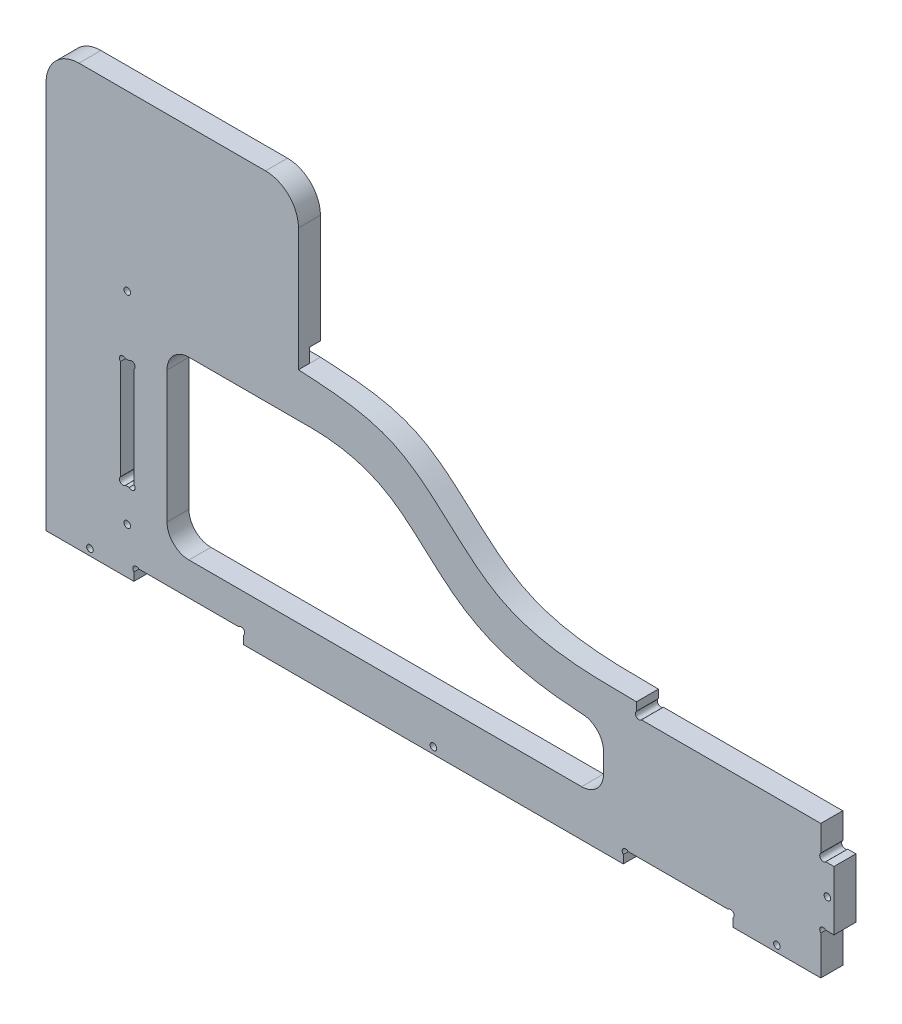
ISO-10303-21;
HEADER;
FILE_DESCRIPTION(('STEP AP214'),'2;1');
FILE_NAME('part.step','',(''),(''),'','','');
FILE_SCHEMA(('AUTOMOTIVE_DESIGN { 1 0 10303 214 1 1 1 1 }'));
ENDSEC;
DATA;
#1=APPLICATION_CONTEXT('core data for automotive mechanical design processes');
#2=APPLICATION_PROTOCOL_DEFINITION('international standard','automotive_design',2000,#1);
#3=PRODUCT_CONTEXT('',#1,'mechanical');
#4=PRODUCT('Part','Part','',(#3));
#5=PRODUCT_RELATED_PRODUCT_CATEGORY('part','',(#4));
#6=PRODUCT_DEFINITION_FORMATION('','',#4);
#7=PRODUCT_DEFINITION_CONTEXT('part definition',#1,'design');
#8=PRODUCT_DEFINITION('design','',#6,#7);
#9=PRODUCT_DEFINITION_SHAPE('','',#8);
#10=(LENGTH_UNIT() NAMED_UNIT(*) SI_UNIT(.MILLI.,.METRE.));
#11=(NAMED_UNIT(*) PLANE_ANGLE_UNIT() SI_UNIT($,.RADIAN.));
#12=(NAMED_UNIT(*) SI_UNIT($,.STERADIAN.) SOLID_ANGLE_UNIT());
#13=UNCERTAINTY_MEASURE_WITH_UNIT(LENGTH_MEASURE(1.E-05),#10,'distance_accuracy_value','');
#14=(GEOMETRIC_REPRESENTATION_CONTEXT(3) GLOBAL_UNCERTAINTY_ASSIGNED_CONTEXT((#13)) GLOBAL_UNIT_ASSIGNED_CONTEXT((#10,
#11,#12)) REPRESENTATION_CONTEXT('',''));
#15=CARTESIAN_POINT('',(0.,0.,0.));
#16=DIRECTION('',(0.,0.,1.));
#17=DIRECTION('',(1.,0.,0.));
#18=AXIS2_PLACEMENT_3D('',#15,#16,#17);
#19=CARTESIAN_POINT('',(294.761857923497,-27.7466666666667,10.));
#20=DIRECTION('',(-1.,0.,0.));
#21=DIRECTION('',(0.,0.,1.));
#22=AXIS2_PLACEMENT_3D('',#19,#20,#21);
#23=PLANE('',#22);
#24=DIRECTION('',(0.,1.,0.));
#25=VECTOR('',#24,1.);
#26=CARTESIAN_POINT('',(294.761857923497,-27.7466666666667,10.));
#27=LINE('',#26,#25);
#28=CARTESIAN_POINT('',(294.761857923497,-39.4847716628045,10.));
#29=VERTEX_POINT('',#28);
#30=CARTESIAN_POINT('',(294.761857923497,-27.7466666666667,10.));
#31=VERTEX_POINT('',#30);
#32=EDGE_CURVE('E618',#29,#31,#27,.T.);
#33=ORIENTED_EDGE('',*,*,#32,.F.);
#34=DIRECTION('',(0.,0.,1.));
#35=VECTOR('',#34,1.);
#36=CARTESIAN_POINT('',(294.761857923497,-39.4847716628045,0.));
#37=LINE('',#36,#35);
#38=CARTESIAN_POINT('',(294.761857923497,-39.4847716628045,0.));
#39=VERTEX_POINT('',#38);
#40=EDGE_CURVE('E453',#29,#39,#37,.F.);
#41=ORIENTED_EDGE('',*,*,#40,.T.);
#42=DIRECTION('',(0.,1.,0.));
#43=VECTOR('',#42,1.);
#44=CARTESIAN_POINT('',(294.761857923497,-27.7466666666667,0.));
#45=LINE('',#44,#43);
#46=CARTESIAN_POINT('',(294.761857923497,-27.7466666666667,0.));
#47=VERTEX_POINT('',#46);
#48=EDGE_CURVE('E676',#39,#47,#45,.T.);
#49=ORIENTED_EDGE('',*,*,#48,.T.);
#50=DIRECTION('',(0.,0.,-1.));
#51=VECTOR('',#50,1.);
#52=CARTESIAN_POINT('',(294.761857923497,-27.7466666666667,10.));
#53=LINE('',#52,#51);
#54=EDGE_CURVE('E943',#31,#47,#53,.T.);
#55=ORIENTED_EDGE('',*,*,#54,.F.);
#56=EDGE_LOOP('',(#33,#41,#49,#55));
#57=FACE_BOUND('',#56,.T.);
#58=ADVANCED_FACE('F30',(#57),#23,.F.);
#59=CARTESIAN_POINT('',(294.761857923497,-88.7466666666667,0.));
#60=VERTEX_POINT('',#59);
#61=CARTESIAN_POINT('',(294.761857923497,-71.0085616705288,0.));
#62=VERTEX_POINT('',#61);
#63=EDGE_CURVE('E633',#60,#62,#45,.T.);
#64=ORIENTED_EDGE('',*,*,#63,.T.);
#65=DIRECTION('',(0.,0.,1.));
#66=VECTOR('',#65,1.);
#67=CARTESIAN_POINT('',(294.761857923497,-71.0085616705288,0.));
#68=LINE('',#67,#66);
#69=CARTESIAN_POINT('',(294.761857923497,-71.0085616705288,10.));
#70=VERTEX_POINT('',#69);
#71=EDGE_CURVE('E445',#62,#70,#68,.T.);
#72=ORIENTED_EDGE('',*,*,#71,.T.);
#73=CARTESIAN_POINT('',(294.761857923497,-88.7466666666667,10.));
#74=VERTEX_POINT('',#73);
#75=EDGE_CURVE('E629',#74,#70,#27,.T.);
#76=ORIENTED_EDGE('',*,*,#75,.F.);
#77=DIRECTION('',(0.,0.,-1.));
#78=VECTOR('',#77,1.);
#79=CARTESIAN_POINT('',(294.761857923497,-88.7466666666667,10.));
#80=LINE('',#79,#78);
#81=EDGE_CURVE('E903',#74,#60,#80,.T.);
#82=ORIENTED_EDGE('',*,*,#81,.T.);
#83=EDGE_LOOP('',(#64,#72,#76,#82));
#84=FACE_BOUND('',#83,.T.);
#85=ADVANCED_FACE('F789',(#84),#23,.F.);
#86=CARTESIAN_POINT('',(-58.2381420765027,-88.7466666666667,10.));
#87=DIRECTION('',(0.,1.,0.));
#88=DIRECTION('',(0.,0.,1.));
#89=AXIS2_PLACEMENT_3D('',#86,#87,#88);
#90=PLANE('',#89);
#91=DIRECTION('',(1.,0.,0.));
#92=VECTOR('',#91,1.);
#93=CARTESIAN_POINT('',(-58.2381420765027,-88.7466666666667,0.));
#94=LINE('',#93,#92);
#95=CARTESIAN_POINT('',(-58.2381420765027,-88.7466666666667,0.));
#96=VERTEX_POINT('',#95);
#97=CARTESIAN_POINT('',(-18.2381420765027,-88.7466666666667,0.));
#98=VERTEX_POINT('',#97);
#99=EDGE_CURVE('E677',#96,#98,#94,.T.);
#100=ORIENTED_EDGE('',*,*,#99,.T.);
#101=DIRECTION('',(0.,0.,1.));
#102=VECTOR('',#101,1.);
#103=CARTESIAN_POINT('',(-18.2381420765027,-88.7466666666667,0.));
#104=LINE('',#103,#102);
#105=CARTESIAN_POINT('',(-18.2381420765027,-88.7466666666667,10.));
#106=VERTEX_POINT('',#105);
#107=EDGE_CURVE('E555',#98,#106,#104,.T.);
#108=ORIENTED_EDGE('',*,*,#107,.T.);
#109=DIRECTION('',(1.,0.,0.));
#110=VECTOR('',#109,1.);
#111=CARTESIAN_POINT('',(-58.2381420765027,-88.7466666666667,10.));
#112=LINE('',#111,#110);
#113=CARTESIAN_POINT('',(-58.2381420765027,-88.7466666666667,10.));
#114=VERTEX_POINT('',#113);
#115=EDGE_CURVE('E615',#114,#106,#112,.T.);
#116=ORIENTED_EDGE('',*,*,#115,.F.);
#117=DIRECTION('',(0.,0.,-1.));
#118=VECTOR('',#117,1.);
#119=CARTESIAN_POINT('',(-58.2381420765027,-88.7466666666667,10.));
#120=LINE('',#119,#118);
#121=EDGE_CURVE('E711',#114,#96,#120,.T.);
#122=ORIENTED_EDGE('',*,*,#121,.T.);
#123=EDGE_LOOP('',(#100,#108,#116,#122));
#124=FACE_BOUND('',#123,.T.);
#125=ADVANCED_FACE('F794',(#124),#90,.F.);
#126=CARTESIAN_POINT('',(254.761857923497,-88.7466666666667,10.));
#127=VERTEX_POINT('',#126);
#128=EDGE_CURVE('E613',#127,#74,#112,.T.);
#129=ORIENTED_EDGE('',*,*,#128,.F.);
#130=DIRECTION('',(0.,0.,1.));
#131=VECTOR('',#130,1.);
#132=CARTESIAN_POINT('',(254.761857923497,-88.7466666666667,0.));
#133=LINE('',#132,#131);
#134=CARTESIAN_POINT('',(254.761857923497,-88.7466666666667,0.));
#135=VERTEX_POINT('',#134);
#136=EDGE_CURVE('E585',#135,#127,#133,.T.);
#137=ORIENTED_EDGE('',*,*,#136,.F.);
#138=EDGE_CURVE('E754',#135,#60,#94,.T.);
#139=ORIENTED_EDGE('',*,*,#138,.T.);
#140=ORIENTED_EDGE('',*,*,#81,.F.);
#141=EDGE_LOOP('',(#129,#137,#139,#140));
#142=FACE_BOUND('',#141,.T.);
#143=ADVANCED_FACE('F795',(#142),#90,.F.);
#144=CARTESIAN_POINT('',(131.729419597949,0.292510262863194,0.));
#145=DIRECTION('',(0.,0.,1.));
#146=DIRECTION('',(1.,0.,0.));
#147=AXIS2_PLACEMENT_3D('',#144,#145,#146);
#148=PLANE('',#147);
#149=CARTESIAN_POINT('',(-23.7381420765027,71.2533333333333,0.));
#150=DIRECTION('',(0.,0.,-1.));
#151=DIRECTION('',(-1.,0.,0.));
#152=AXIS2_PLACEMENT_3D('',#149,#150,#151);
#153=CIRCLE('',#152,1.);
#154=CARTESIAN_POINT('',(-24.7381420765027,71.2533333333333,0.));
#155=VERTEX_POINT('',#154);
#156=EDGE_CURVE('E357',#155,#155,#153,.T.);
#157=ORIENTED_EDGE('',*,*,#156,.F.);
#158=EDGE_LOOP('',(#157));
#159=FACE_BOUND('',#158,.T.);
#160=CARTESIAN_POINT('',(22.2618579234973,71.2533333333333,0.));
#161=DIRECTION('',(0.,0.,-1.));
#162=DIRECTION('',(-1.,0.,0.));
#163=AXIS2_PLACEMENT_3D('',#160,#161,#162);
#164=CIRCLE('',#163,1.);
#165=CARTESIAN_POINT('',(21.2618579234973,71.2533333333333,0.));
#166=VERTEX_POINT('',#165);
#167=EDGE_CURVE('E369',#166,#166,#164,.T.);
#168=ORIENTED_EDGE('',*,*,#167,.F.);
#169=EDGE_LOOP('',(#168));
#170=FACE_BOUND('',#169,.T.);
#171=CARTESIAN_POINT('',(-23.7381420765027,93.2533333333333,0.));
#172=DIRECTION('',(0.,0.,-1.));
#173=DIRECTION('',(-1.,0.,0.));
#174=AXIS2_PLACEMENT_3D('',#171,#172,#173);
#175=CIRCLE('',#174,1.);
#176=CARTESIAN_POINT('',(-24.7381420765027,93.2533333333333,0.));
#177=VERTEX_POINT('',#176);
#178=EDGE_CURVE('E375',#177,#177,#175,.T.);
#179=ORIENTED_EDGE('',*,*,#178,.F.);
#180=EDGE_LOOP('',(#179));
#181=FACE_BOUND('',#180,.T.);
#182=CARTESIAN_POINT('',(22.2618579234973,93.2533333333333,0.));
#183=DIRECTION('',(0.,0.,-1.));
#184=DIRECTION('',(-1.,0.,0.));
#185=AXIS2_PLACEMENT_3D('',#182,#183,#184);
#186=CIRCLE('',#185,1.);
#187=CARTESIAN_POINT('',(21.2618579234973,93.2533333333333,0.));
#188=VERTEX_POINT('',#187);
#189=EDGE_CURVE('E381',#188,#188,#186,.T.);
#190=ORIENTED_EDGE('',*,*,#189,.F.);
#191=EDGE_LOOP('',(#190));
#192=FACE_BOUND('',#191,.T.);
#193=DIRECTION('',(-1.,0.,0.));
#194=VECTOR('',#193,1.);
#195=CARTESIAN_POINT('',(56.7618579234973,103.253333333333,0.));
#196=LINE('',#195,#194);
#197=CARTESIAN_POINT('',(41.7618579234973,103.253333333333,0.));
#198=VERTEX_POINT('',#197);
#199=CARTESIAN_POINT('',(-43.2381420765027,103.253333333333,0.));
#200=VERTEX_POINT('',#199);
#201=EDGE_CURVE('E614',#198,#200,#196,.T.);
#202=ORIENTED_EDGE('',*,*,#201,.F.);
#203=CARTESIAN_POINT('',(41.7618579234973,88.2533333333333,0.));
#204=DIRECTION('',(0.,0.,1.));
#205=DIRECTION('',(1.,0.,0.));
#206=AXIS2_PLACEMENT_3D('',#203,#204,#205);
#207=CIRCLE('',#206,15.);
#208=CARTESIAN_POINT('',(56.7618579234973,88.2533333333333,0.));
#209=VERTEX_POINT('',#208);
#210=EDGE_CURVE('E731',#198,#209,#207,.F.);
#211=ORIENTED_EDGE('',*,*,#210,.T.);
#212=DIRECTION('',(0.,1.,0.));
#213=VECTOR('',#212,1.);
#214=CARTESIAN_POINT('',(56.7618579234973,32.2533333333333,0.));
#215=LINE('',#214,#213);
#216=CARTESIAN_POINT('',(56.7618579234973,38.6533333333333,0.));
#217=VERTEX_POINT('',#216);
#218=EDGE_CURVE('E693',#217,#209,#215,.T.);
#219=ORIENTED_EDGE('',*,*,#218,.F.);
#220=DIRECTION('',(1.,0.,0.));
#221=VECTOR('',#220,1.);
#222=CARTESIAN_POINT('',(56.7618579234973,38.6533333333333,0.));
#223=LINE('',#222,#221);
#224=CARTESIAN_POINT('',(-58.2381420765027,38.6533333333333,0.));
#225=VERTEX_POINT('',#224);
#226=EDGE_CURVE('E598',#225,#217,#223,.T.);
#227=ORIENTED_EDGE('',*,*,#226,.F.);
#228=DIRECTION('',(0.,-1.,0.));
#229=VECTOR('',#228,1.);
#230=CARTESIAN_POINT('',(-58.2381420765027,32.2533333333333,0.));
#231=LINE('',#230,#229);
#232=CARTESIAN_POINT('',(-58.2381420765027,88.2533333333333,0.));
#233=VERTEX_POINT('',#232);
#234=EDGE_CURVE('E745',#233,#225,#231,.T.);
#235=ORIENTED_EDGE('',*,*,#234,.F.);
#236=CARTESIAN_POINT('',(-43.2381420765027,88.2533333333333,0.));
#237=DIRECTION('',(0.,0.,1.));
#238=DIRECTION('',(1.,0.,0.));
#239=AXIS2_PLACEMENT_3D('',#236,#237,#238);
#240=CIRCLE('',#239,15.);
#241=EDGE_CURVE('E729',#233,#200,#240,.F.);
#242=ORIENTED_EDGE('',*,*,#241,.T.);
#243=EDGE_LOOP('',(#202,#211,#219,#227,#235,#242));
#244=FACE_BOUND('',#243,.T.);
#245=ADVANCED_FACE('F752',(#159,#170,#181,#192,#244),#148,.F.);
#246=CARTESIAN_POINT('',(-58.2381420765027,32.2533333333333,10.));
#247=DIRECTION('',(1.,0.,0.));
#248=DIRECTION('',(0.,1.,0.));
#249=AXIS2_PLACEMENT_3D('',#246,#247,#248);
#250=PLANE('',#249);
#251=DIRECTION('',(0.,-1.,0.));
#252=VECTOR('',#251,1.);
#253=CARTESIAN_POINT('',(-58.2381420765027,103.253333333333,10.));
#254=LINE('',#253,#252);
#255=CARTESIAN_POINT('',(-58.2381420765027,88.2533333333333,10.));
#256=VERTEX_POINT('',#255);
#257=EDGE_CURVE('E611',#256,#114,#254,.T.);
#258=ORIENTED_EDGE('',*,*,#257,.F.);
#259=DIRECTION('',(0.,0.,-1.));
#260=VECTOR('',#259,1.);
#261=CARTESIAN_POINT('',(-58.2381420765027,88.2533333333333,10.));
#262=LINE('',#261,#260);
#263=EDGE_CURVE('E658',#256,#233,#262,.T.);
#264=ORIENTED_EDGE('',*,*,#263,.T.);
#265=ORIENTED_EDGE('',*,*,#234,.T.);
#266=DIRECTION('',(0.,0.,-1.));
#267=VECTOR('',#266,1.);
#268=CARTESIAN_POINT('',(-58.2381420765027,38.6533333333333,5.));
#269=LINE('',#268,#267);
#270=CARTESIAN_POINT('',(-58.2381420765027,38.6533333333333,5.));
#271=VERTEX_POINT('',#270);
#272=EDGE_CURVE('E605',#271,#225,#269,.T.);
#273=ORIENTED_EDGE('',*,*,#272,.F.);
#274=DIRECTION('',(0.,1.,0.));
#275=VECTOR('',#274,1.);
#276=CARTESIAN_POINT('',(-58.2381420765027,38.6533333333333,5.));
#277=LINE('',#276,#275);
#278=CARTESIAN_POINT('',(-58.2381420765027,32.2533333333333,5.));
#279=VERTEX_POINT('',#278);
#280=EDGE_CURVE('E590',#279,#271,#277,.T.);
#281=ORIENTED_EDGE('',*,*,#280,.F.);
#282=DIRECTION('',(0.,0.,-1.));
#283=VECTOR('',#282,1.);
#284=CARTESIAN_POINT('',(-58.2381420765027,32.2533333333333,5.));
#285=LINE('',#284,#283);
#286=CARTESIAN_POINT('',(-58.2381420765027,32.2533333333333,0.));
#287=VERTEX_POINT('',#286);
#288=EDGE_CURVE('E608',#279,#287,#285,.T.);
#289=ORIENTED_EDGE('',*,*,#288,.T.);
#290=EDGE_CURVE('E604',#287,#96,#231,.T.);
#291=ORIENTED_EDGE('',*,*,#290,.T.);
#292=ORIENTED_EDGE('',*,*,#121,.F.);
#293=EDGE_LOOP('',(#258,#264,#265,#273,#281,#289,#291,#292));
#294=FACE_BOUND('',#293,.T.);
#295=ADVANCED_FACE('F743',(#294),#250,.F.);
#296=CARTESIAN_POINT('',(31.7618579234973,-88.7466666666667,10.));
#297=VERTEX_POINT('',#296);
#298=CARTESIAN_POINT('',(204.761857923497,-88.7466666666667,10.));
#299=VERTEX_POINT('',#298);
#300=EDGE_CURVE('E619',#297,#299,#112,.T.);
#301=ORIENTED_EDGE('',*,*,#300,.F.);
#302=DIRECTION('',(0.,0.,1.));
#303=VECTOR('',#302,1.);
#304=CARTESIAN_POINT('',(31.7618579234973,-88.7466666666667,0.));
#305=LINE('',#304,#303);
#306=CARTESIAN_POINT('',(31.7618579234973,-88.7466666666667,0.));
#307=VERTEX_POINT('',#306);
#308=EDGE_CURVE('E564',#307,#297,#305,.T.);
#309=ORIENTED_EDGE('',*,*,#308,.F.);
#310=CARTESIAN_POINT('',(204.761857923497,-88.7466666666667,0.));
#311=VERTEX_POINT('',#310);
#312=EDGE_CURVE('E755',#307,#311,#94,.T.);
#313=ORIENTED_EDGE('',*,*,#312,.T.);
#314=DIRECTION('',(0.,0.,1.));
#315=VECTOR('',#314,1.);
#316=CARTESIAN_POINT('',(204.761857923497,-88.7466666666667,0.));
#317=LINE('',#316,#315);
#318=EDGE_CURVE('E578',#311,#299,#317,.T.);
#319=ORIENTED_EDGE('',*,*,#318,.T.);
#320=EDGE_LOOP('',(#301,#309,#313,#319));
#321=FACE_BOUND('',#320,.T.);
#322=ADVANCED_FACE('F785',(#321),#90,.F.);
#323=CARTESIAN_POINT('',(294.761857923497,-27.7466666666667,10.));
#324=DIRECTION('',(0.,-1.,0.));
#325=DIRECTION('',(1.,0.,0.));
#326=AXIS2_PLACEMENT_3D('',#323,#324,#325);
#327=PLANE('',#326);
#328=DIRECTION('',(-1.,0.,0.));
#329=VECTOR('',#328,1.);
#330=CARTESIAN_POINT('',(294.761857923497,-27.7466666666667,0.));
#331=LINE('',#330,#329);
#332=CARTESIAN_POINT('',(213.023752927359,-27.7466666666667,0.));
#333=VERTEX_POINT('',#332);
#334=EDGE_CURVE('E682',#47,#333,#331,.T.);
#335=ORIENTED_EDGE('',*,*,#334,.T.);
#336=DIRECTION('',(0.,0.,1.));
#337=VECTOR('',#336,1.);
#338=CARTESIAN_POINT('',(213.023752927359,-27.7466666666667,0.));
#339=LINE('',#338,#337);
#340=CARTESIAN_POINT('',(213.023752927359,-27.7466666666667,10.));
#341=VERTEX_POINT('',#340);
#342=EDGE_CURVE('E513',#333,#341,#339,.T.);
#343=ORIENTED_EDGE('',*,*,#342,.T.);
#344=DIRECTION('',(-1.,0.,0.));
#345=VECTOR('',#344,1.);
#346=CARTESIAN_POINT('',(294.761857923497,-27.7466666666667,10.));
#347=LINE('',#346,#345);
#348=EDGE_CURVE('E622',#31,#341,#347,.T.);
#349=ORIENTED_EDGE('',*,*,#348,.F.);
#350=ORIENTED_EDGE('',*,*,#54,.T.);
#351=EDGE_LOOP('',(#335,#343,#349,#350));
#352=FACE_BOUND('',#351,.T.);
#353=ADVANCED_FACE('F781',(#352),#327,.F.);
#354=CARTESIAN_POINT('',(210.761857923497,-27.7466666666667,10.));
#355=DIRECTION('',(-1.,0.,0.));
#356=DIRECTION('',(0.,0.,1.));
#357=AXIS2_PLACEMENT_3D('',#354,#355,#356);
#358=PLANE('',#357);
#359=DIRECTION('',(0.,1.,0.));
#360=VECTOR('',#359,1.);
#361=CARTESIAN_POINT('',(210.761857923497,-27.7466666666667,10.));
#362=LINE('',#361,#360);
#363=CARTESIAN_POINT('',(210.761857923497,-25.4847716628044,10.));
#364=VERTEX_POINT('',#363);
#365=CARTESIAN_POINT('',(210.761857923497,-21.7466666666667,10.));
#366=VERTEX_POINT('',#365);
#367=EDGE_CURVE('E766',#364,#366,#362,.T.);
#368=ORIENTED_EDGE('',*,*,#367,.F.);
#369=DIRECTION('',(0.,0.,1.));
#370=VECTOR('',#369,1.);
#371=CARTESIAN_POINT('',(210.761857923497,-25.4847716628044,0.));
#372=LINE('',#371,#370);
#373=CARTESIAN_POINT('',(210.761857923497,-25.4847716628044,0.));
#374=VERTEX_POINT('',#373);
#375=EDGE_CURVE('E509',#364,#374,#372,.F.);
#376=ORIENTED_EDGE('',*,*,#375,.T.);
#377=DIRECTION('',(0.,1.,0.));
#378=VECTOR('',#377,1.);
#379=CARTESIAN_POINT('',(210.761857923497,-27.7466666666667,0.));
#380=LINE('',#379,#378);
#381=CARTESIAN_POINT('',(210.761857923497,-21.7466666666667,0.));
#382=VERTEX_POINT('',#381);
#383=EDGE_CURVE('E686',#374,#382,#380,.T.);
#384=ORIENTED_EDGE('',*,*,#383,.T.);
#385=DIRECTION('',(0.,0.,-1.));
#386=VECTOR('',#385,1.);
#387=CARTESIAN_POINT('',(210.761857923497,-21.7466666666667,10.));
#388=LINE('',#387,#386);
#389=EDGE_CURVE('E703',#366,#382,#388,.T.);
#390=ORIENTED_EDGE('',*,*,#389,.F.);
#391=EDGE_LOOP('',(#368,#376,#384,#390));
#392=FACE_BOUND('',#391,.T.);
#393=ADVANCED_FACE('F776',(#392),#358,.F.);
#394=CARTESIAN_POINT('',(210.761857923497,-21.7466666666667,10.));
#395=CARTESIAN_POINT('',(188.085784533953,-21.6551548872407,10.));
#396=CARTESIAN_POINT('',(145.071823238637,-21.4815673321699,10.));
#397=CARTESIAN_POINT('',(108.220083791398,29.468815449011,10.));
#398=CARTESIAN_POINT('',(72.4874891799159,31.4023848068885,10.));
#399=CARTESIAN_POINT('',(56.7618579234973,32.2533333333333,10.));
#400=B_SPLINE_CURVE_WITH_KNOTS('',3,(#394,#395,#396,#397,#398,#399),.UNSPECIFIED.,.F.,.F.,(4,1,
1,4),(0.,0.384342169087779,0.729053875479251,1.),.UNSPECIFIED.);
#401=DIRECTION('',(0.,0.,-1.));
#402=VECTOR('',#401,1.);
#403=SURFACE_OF_LINEAR_EXTRUSION('',#400,#402);
#404=CARTESIAN_POINT('',(210.761857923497,-21.7466666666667,0.));
#405=CARTESIAN_POINT('',(188.085784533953,-21.6551548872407,0.));
#406=CARTESIAN_POINT('',(145.071823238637,-21.4815673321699,0.));
#407=CARTESIAN_POINT('',(108.220083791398,29.468815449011,0.));
#408=CARTESIAN_POINT('',(72.4874891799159,31.4023848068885,0.));
#409=CARTESIAN_POINT('',(56.7618579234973,32.2533333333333,0.));
#410=B_SPLINE_CURVE_WITH_KNOTS('',3,(#404,#405,#406,#407,#408,#409),.UNSPECIFIED.,.F.,.F.,(4,1,
1,4),(0.,0.384342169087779,0.729053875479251,1.),.UNSPECIFIED.);
#411=CARTESIAN_POINT('',(56.7618579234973,32.2533333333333,0.));
#412=VERTEX_POINT('',#411);
#413=EDGE_CURVE('E688',#382,#412,#410,.T.);
#414=ORIENTED_EDGE('',*,*,#413,.T.);
#415=DIRECTION('',(0.,0.,-1.));
#416=VECTOR('',#415,1.);
#417=CARTESIAN_POINT('',(56.7618579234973,32.2533333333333,5.));
#418=LINE('',#417,#416);
#419=CARTESIAN_POINT('',(56.7618579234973,32.2533333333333,5.));
#420=VERTEX_POINT('',#419);
#421=EDGE_CURVE('E596',#420,#412,#418,.T.);
#422=ORIENTED_EDGE('',*,*,#421,.F.);
#423=DIRECTION('',(0.,0.,-1.));
#424=VECTOR('',#423,1.);
#425=CARTESIAN_POINT('',(56.7618579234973,32.2533333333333,10.));
#426=LINE('',#425,#424);
#427=CARTESIAN_POINT('',(56.7618579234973,32.2533333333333,10.));
#428=VERTEX_POINT('',#427);
#429=EDGE_CURVE('E706',#428,#420,#426,.T.);
#430=ORIENTED_EDGE('',*,*,#429,.F.);
#431=EDGE_CURVE('E762',#366,#428,#400,.T.);
#432=ORIENTED_EDGE('',*,*,#431,.F.);
#433=ORIENTED_EDGE('',*,*,#389,.T.);
#434=EDGE_LOOP('',(#414,#422,#430,#432,#433));
#435=FACE_BOUND('',#434,.T.);
#436=ADVANCED_FACE('F771',(#435),#403,.F.);
#437=CARTESIAN_POINT('',(56.7618579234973,32.2533333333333,10.));
#438=DIRECTION('',(-1.,0.,0.));
#439=DIRECTION('',(0.,0.,1.));
#440=AXIS2_PLACEMENT_3D('',#437,#438,#439);
#441=PLANE('',#440);
#442=ORIENTED_EDGE('',*,*,#218,.T.);
#443=DIRECTION('',(0.,0.,-1.));
#444=VECTOR('',#443,1.);
#445=CARTESIAN_POINT('',(56.7618579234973,88.2533333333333,10.));
#446=LINE('',#445,#444);
#447=CARTESIAN_POINT('',(56.7618579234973,88.2533333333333,10.));
#448=VERTEX_POINT('',#447);
#449=EDGE_CURVE('E733',#209,#448,#446,.F.);
#450=ORIENTED_EDGE('',*,*,#449,.T.);
#451=DIRECTION('',(0.,1.,0.));
#452=VECTOR('',#451,1.);
#453=CARTESIAN_POINT('',(56.7618579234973,32.2533333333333,10.));
#454=LINE('',#453,#452);
#455=EDGE_CURVE('E759',#428,#448,#454,.T.);
#456=ORIENTED_EDGE('',*,*,#455,.F.);
#457=ORIENTED_EDGE('',*,*,#429,.T.);
#458=DIRECTION('',(0.,-1.,0.));
#459=VECTOR('',#458,1.);
#460=CARTESIAN_POINT('',(56.7618579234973,38.6533333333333,5.));
#461=LINE('',#460,#459);
#462=CARTESIAN_POINT('',(56.7618579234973,38.6533333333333,5.));
#463=VERTEX_POINT('',#462);
#464=EDGE_CURVE('E600',#463,#420,#461,.T.);
#465=ORIENTED_EDGE('',*,*,#464,.F.);
#466=DIRECTION('',(0.,0.,-1.));
#467=VECTOR('',#466,1.);
#468=CARTESIAN_POINT('',(56.7618579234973,38.6533333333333,5.));
#469=LINE('',#468,#467);
#470=EDGE_CURVE('E601',#463,#217,#469,.T.);
#471=ORIENTED_EDGE('',*,*,#470,.T.);
#472=EDGE_LOOP('',(#442,#450,#456,#457,#465,#471));
#473=FACE_BOUND('',#472,.T.);
#474=ADVANCED_FACE('F775',(#473),#441,.F.);
#475=CARTESIAN_POINT('',(56.7618579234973,103.253333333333,10.));
#476=DIRECTION('',(0.,-1.,0.));
#477=DIRECTION('',(0.,0.,-1.));
#478=AXIS2_PLACEMENT_3D('',#475,#476,#477);
#479=PLANE('',#478);
#480=DIRECTION('',(-1.,0.,0.));
#481=VECTOR('',#480,1.);
#482=CARTESIAN_POINT('',(56.7618579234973,103.253333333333,10.));
#483=LINE('',#482,#481);
#484=CARTESIAN_POINT('',(41.7618579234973,103.253333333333,10.));
#485=VERTEX_POINT('',#484);
#486=CARTESIAN_POINT('',(-43.2381420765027,103.253333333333,10.));
#487=VERTEX_POINT('',#486);
#488=EDGE_CURVE('E710',#485,#487,#483,.T.);
#489=ORIENTED_EDGE('',*,*,#488,.F.);
#490=DIRECTION('',(0.,0.,-1.));
#491=VECTOR('',#490,1.);
#492=CARTESIAN_POINT('',(41.7618579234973,103.253333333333,10.));
#493=LINE('',#492,#491);
#494=EDGE_CURVE('E726',#485,#198,#493,.T.);
#495=ORIENTED_EDGE('',*,*,#494,.T.);
#496=ORIENTED_EDGE('',*,*,#201,.T.);
#497=DIRECTION('',(0.,0.,-1.));
#498=VECTOR('',#497,1.);
#499=CARTESIAN_POINT('',(-43.2381420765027,103.253333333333,10.));
#500=LINE('',#499,#498);
#501=EDGE_CURVE('E724',#200,#487,#500,.F.);
#502=ORIENTED_EDGE('',*,*,#501,.T.);
#503=EDGE_LOOP('',(#489,#495,#496,#502));
#504=FACE_BOUND('',#503,.T.);
#505=ADVANCED_FACE('F970',(#504),#479,.F.);
#506=CARTESIAN_POINT('',(131.729419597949,0.292510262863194,10.));
#507=DIRECTION('',(0.,0.,1.));
#508=DIRECTION('',(1.,0.,0.));
#509=AXIS2_PLACEMENT_3D('',#506,#507,#508);
#510=PLANE('',#509);
#511=DIRECTION('',(0.,-1.,0.));
#512=VECTOR('',#511,1.);
#513=CARTESIAN_POINT('',(-3.1381420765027,-67.7466666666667,10.));
#514=LINE('',#513,#512);
#515=CARTESIAN_POINT('',(-3.1381420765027,2.25333333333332,10.));
#516=VERTEX_POINT('',#515);
#517=CARTESIAN_POINT('',(-3.1381420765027,-57.7466666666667,10.));
#518=VERTEX_POINT('',#517);
#519=EDGE_CURVE('E1441',#516,#518,#514,.T.);
#520=ORIENTED_EDGE('',*,*,#519,.F.);
#521=CARTESIAN_POINT('',(6.8618579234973,2.25333333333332,10.));
#522=DIRECTION('',(0.,0.,1.));
#523=DIRECTION('',(1.,0.,0.));
#524=AXIS2_PLACEMENT_3D('',#521,#522,#523);
#525=CIRCLE('',#524,10.);
#526=CARTESIAN_POINT('',(6.8618579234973,12.2533333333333,10.));
#527=VERTEX_POINT('',#526);
#528=EDGE_CURVE('E38',#516,#527,#525,.F.);
#529=ORIENTED_EDGE('',*,*,#528,.T.);
#530=DIRECTION('',(-1.,0.,0.));
#531=VECTOR('',#530,1.);
#532=CARTESIAN_POINT('',(-3.1381420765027,12.2533333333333,10.));
#533=LINE('',#532,#531);
#534=CARTESIAN_POINT('',(57.4355260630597,12.2533333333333,10.));
#535=VERTEX_POINT('',#534);
#536=EDGE_CURVE('E352',#535,#527,#533,.T.);
#537=ORIENTED_EDGE('',*,*,#536,.F.);
#538=CARTESIAN_POINT('',(195.761857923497,-39.3029517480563,10.));
#539=CARTESIAN_POINT('',(169.116495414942,-38.5764359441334,10.));
#540=CARTESIAN_POINT('',(135.64186927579,-33.7594814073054,10.));
#541=CARTESIAN_POINT('',(95.7734317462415,11.1890765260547,10.));
#542=CARTESIAN_POINT('',(70.032182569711,12.5021089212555,10.));
#543=CARTESIAN_POINT('',(57.4355260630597,12.2533333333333,10.));
#544=B_SPLINE_CURVE_WITH_KNOTS('',3,(#538,#539,#540,#541,#542,#543),.UNSPECIFIED.,.F.,.F.,(4,1,
1,4),(0.,0.417016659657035,0.650786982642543,1.),.UNSPECIFIED.);
#545=CARTESIAN_POINT('',(186.315656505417,-38.9220579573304,10.));
#546=VERTEX_POINT('',#545);
#547=EDGE_CURVE('E345',#546,#535,#544,.T.);
#548=ORIENTED_EDGE('',*,*,#547,.F.);
#549=CARTESIAN_POINT('',(185.761857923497,-48.9067115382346,10.));
#550=DIRECTION('',(0.,0.,1.));
#551=DIRECTION('',(1.,0.,0.));
#552=AXIS2_PLACEMENT_3D('',#549,#550,#551);
#553=CIRCLE('',#552,10.);
#554=CARTESIAN_POINT('',(195.761857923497,-48.9067115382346,10.));
#555=VERTEX_POINT('',#554);
#556=EDGE_CURVE('E843',#546,#555,#553,.F.);
#557=ORIENTED_EDGE('',*,*,#556,.T.);
#558=DIRECTION('',(0.,1.,0.));
#559=VECTOR('',#558,1.);
#560=CARTESIAN_POINT('',(195.761857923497,-67.7466666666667,10.));
#561=LINE('',#560,#559);
#562=CARTESIAN_POINT('',(195.761857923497,-57.7466666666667,10.));
#563=VERTEX_POINT('',#562);
#564=EDGE_CURVE('E353',#563,#555,#561,.T.);
#565=ORIENTED_EDGE('',*,*,#564,.F.);
#566=CARTESIAN_POINT('',(185.761857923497,-57.7466666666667,10.));
#567=DIRECTION('',(0.,0.,1.));
#568=DIRECTION('',(1.,0.,0.));
#569=AXIS2_PLACEMENT_3D('',#566,#567,#568);
#570=CIRCLE('',#569,10.);
#571=CARTESIAN_POINT('',(185.761857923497,-67.7466666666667,10.));
#572=VERTEX_POINT('',#571);
#573=EDGE_CURVE('E839',#563,#572,#570,.F.);
#574=ORIENTED_EDGE('',*,*,#573,.T.);
#575=DIRECTION('',(1.,0.,0.));
#576=VECTOR('',#575,1.);
#577=CARTESIAN_POINT('',(-3.1381420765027,-67.7466666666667,10.));
#578=LINE('',#577,#576);
#579=CARTESIAN_POINT('',(6.8618579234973,-67.7466666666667,10.));
#580=VERTEX_POINT('',#579);
#581=EDGE_CURVE('E1447',#580,#572,#578,.T.);
#582=ORIENTED_EDGE('',*,*,#581,.F.);
#583=CARTESIAN_POINT('',(6.8618579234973,-57.7466666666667,10.));
#584=DIRECTION('',(0.,0.,1.));
#585=DIRECTION('',(1.,0.,0.));
#586=AXIS2_PLACEMENT_3D('',#583,#584,#585);
#587=CIRCLE('',#586,10.);
#588=EDGE_CURVE('E833',#580,#518,#587,.F.);
#589=ORIENTED_EDGE('',*,*,#588,.T.);
#590=EDGE_LOOP('',(#520,#529,#537,#548,#557,#565,#574,#582,#589));
#591=FACE_BOUND('',#590,.T.);
#592=CARTESIAN_POINT('',(-21.2381420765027,24.2533333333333,10.));
#593=DIRECTION('',(0.,0.,1.));
#594=DIRECTION('',(1.,0.,0.));
#595=AXIS2_PLACEMENT_3D('',#592,#593,#594);
#596=CIRCLE('',#595,1.5);
#597=CARTESIAN_POINT('',(-19.7381420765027,24.2533333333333,10.));
#598=VERTEX_POINT('',#597);
#599=EDGE_CURVE('E387',#598,#598,#596,.T.);
#600=ORIENTED_EDGE('',*,*,#599,.F.);
#601=EDGE_LOOP('',(#600));
#602=FACE_BOUND('',#601,.T.);
#603=CARTESIAN_POINT('',(-21.2381420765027,-67.7466666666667,10.));
#604=DIRECTION('',(0.,0.,1.));
#605=DIRECTION('',(1.,0.,0.));
#606=AXIS2_PLACEMENT_3D('',#603,#604,#605);
#607=CIRCLE('',#606,1.5);
#608=CARTESIAN_POINT('',(-19.7381420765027,-67.7466666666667,10.));
#609=VERTEX_POINT('',#608);
#610=EDGE_CURVE('E393',#609,#609,#607,.T.);
#611=ORIENTED_EDGE('',*,*,#610,.F.);
#612=EDGE_LOOP('',(#611));
#613=FACE_BOUND('',#612,.T.);
#614=CARTESIAN_POINT('',(297.761857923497,-55.2466666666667,10.));
#615=DIRECTION('',(0.,0.,1.));
#616=DIRECTION('',(1.,0.,0.));
#617=AXIS2_PLACEMENT_3D('',#614,#615,#616);
#618=CIRCLE('',#617,1.50000000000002);
#619=CARTESIAN_POINT('',(299.261857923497,-55.2466666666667,10.));
#620=VERTEX_POINT('',#619);
#621=EDGE_CURVE('E399',#620,#620,#618,.T.);
#622=ORIENTED_EDGE('',*,*,#621,.F.);
#623=EDGE_LOOP('',(#622));
#624=FACE_BOUND('',#623,.T.);
#625=CARTESIAN_POINT('',(274.761857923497,-85.7466666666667,10.));
#626=DIRECTION('',(0.,0.,1.));
#627=DIRECTION('',(1.,0.,0.));
#628=AXIS2_PLACEMENT_3D('',#625,#626,#627);
#629=CIRCLE('',#628,1.50000000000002);
#630=CARTESIAN_POINT('',(276.261857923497,-85.7466666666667,10.));
#631=VERTEX_POINT('',#630);
#632=EDGE_CURVE('E405',#631,#631,#629,.T.);
#633=ORIENTED_EDGE('',*,*,#632,.F.);
#634=EDGE_LOOP('',(#633));
#635=FACE_BOUND('',#634,.T.);
#636=CARTESIAN_POINT('',(118.261857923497,-85.7466666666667,10.));
#637=DIRECTION('',(0.,0.,1.));
#638=DIRECTION('',(1.,0.,0.));
#639=AXIS2_PLACEMENT_3D('',#636,#637,#638);
#640=CIRCLE('',#639,1.5);
#641=CARTESIAN_POINT('',(119.761857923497,-85.7466666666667,10.));
#642=VERTEX_POINT('',#641);
#643=EDGE_CURVE('E411',#642,#642,#640,.T.);
#644=ORIENTED_EDGE('',*,*,#643,.F.);
#645=EDGE_LOOP('',(#644));
#646=FACE_BOUND('',#645,.T.);
#647=CARTESIAN_POINT('',(-38.2381420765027,-85.7466666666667,10.));
#648=DIRECTION('',(0.,0.,1.));
#649=DIRECTION('',(1.,0.,0.));
#650=AXIS2_PLACEMENT_3D('',#647,#648,#649);
#651=CIRCLE('',#650,1.5);
#652=CARTESIAN_POINT('',(-36.7381420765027,-85.7466666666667,10.));
#653=VERTEX_POINT('',#652);
#654=EDGE_CURVE('E417',#653,#653,#651,.T.);
#655=ORIENTED_EDGE('',*,*,#654,.F.);
#656=EDGE_LOOP('',(#655));
#657=FACE_BOUND('',#656,.T.);
#658=CARTESIAN_POINT('',(-23.2381420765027,-51.6466666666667,10.));
#659=DIRECTION('',(0.,0.,1.));
#660=DIRECTION('',(1.,0.,0.));
#661=AXIS2_PLACEMENT_3D('',#658,#659,#660);
#662=CIRCLE('',#661,1.6);
#663=CARTESIAN_POINT('',(-24.3381420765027,-50.4847716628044,10.));
#664=VERTEX_POINT('',#663);
#665=CARTESIAN_POINT('',(-22.0762470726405,-52.7466666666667,10.));
#666=VERTEX_POINT('',#665);
#667=EDGE_CURVE('E423',#664,#666,#662,.T.);
#668=ORIENTED_EDGE('',*,*,#667,.F.);
#669=DIRECTION('',(0.,-1.,0.));
#670=VECTOR('',#669,1.);
#671=CARTESIAN_POINT('',(-24.3381420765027,-2.74666666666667,10.));
#672=LINE('',#671,#670);
#673=CARTESIAN_POINT('',(-24.3381420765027,-5.0085616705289,10.));
#674=VERTEX_POINT('',#673);
#675=EDGE_CURVE('E516',#674,#664,#672,.T.);
#676=ORIENTED_EDGE('',*,*,#675,.F.);
#677=CARTESIAN_POINT('',(-23.2381420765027,-3.84666666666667,10.));
#678=DIRECTION('',(0.,0.,1.));
#679=DIRECTION('',(1.,0.,0.));
#680=AXIS2_PLACEMENT_3D('',#677,#678,#679);
#681=CIRCLE('',#680,1.6);
#682=CARTESIAN_POINT('',(-22.0762470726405,-2.74666666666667,10.));
#683=VERTEX_POINT('',#682);
#684=EDGE_CURVE('E457',#683,#674,#681,.T.);
#685=ORIENTED_EDGE('',*,*,#684,.F.);
#686=DIRECTION('',(-1.,0.,0.));
#687=VECTOR('',#686,1.);
#688=CARTESIAN_POINT('',(-24.3381420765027,-2.74666666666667,10.));
#689=LINE('',#688,#687);
#690=CARTESIAN_POINT('',(-20.4000370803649,-2.74666666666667,10.));
#691=VERTEX_POINT('',#690);
#692=EDGE_CURVE('E521',#691,#683,#689,.T.);
#693=ORIENTED_EDGE('',*,*,#692,.F.);
#694=CARTESIAN_POINT('',(-19.2381420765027,-3.84666666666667,10.));
#695=DIRECTION('',(0.,0.,1.));
#696=DIRECTION('',(1.,0.,0.));
#697=AXIS2_PLACEMENT_3D('',#694,#695,#696);
#698=CIRCLE('',#697,1.6);
#699=CARTESIAN_POINT('',(-18.1381420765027,-5.0085616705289,10.));
#700=VERTEX_POINT('',#699);
#701=EDGE_CURVE('E465',#700,#691,#698,.T.);
#702=ORIENTED_EDGE('',*,*,#701,.F.);
#703=DIRECTION('',(0.,1.,0.));
#704=VECTOR('',#703,1.);
#705=CARTESIAN_POINT('',(-18.1381420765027,-2.74666666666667,10.));
#706=LINE('',#705,#704);
#707=CARTESIAN_POINT('',(-18.1381420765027,-50.4847716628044,10.));
#708=VERTEX_POINT('',#707);
#709=EDGE_CURVE('E533',#708,#700,#706,.T.);
#710=ORIENTED_EDGE('',*,*,#709,.F.);
#711=CARTESIAN_POINT('',(-19.2381420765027,-51.6466666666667,10.));
#712=DIRECTION('',(0.,0.,1.));
#713=DIRECTION('',(1.,0.,0.));
#714=AXIS2_PLACEMENT_3D('',#711,#712,#713);
#715=CIRCLE('',#714,1.6);
#716=CARTESIAN_POINT('',(-20.4000370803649,-52.7466666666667,10.));
#717=VERTEX_POINT('',#716);
#718=EDGE_CURVE('E433',#717,#708,#715,.T.);
#719=ORIENTED_EDGE('',*,*,#718,.F.);
#720=DIRECTION('',(1.,0.,0.));
#721=VECTOR('',#720,1.);
#722=CARTESIAN_POINT('',(-24.3381420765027,-52.7466666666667,10.));
#723=LINE('',#722,#721);
#724=EDGE_CURVE('E531',#666,#717,#723,.T.);
#725=ORIENTED_EDGE('',*,*,#724,.F.);
#726=EDGE_LOOP('',(#668,#676,#685,#693,#702,#710,#719,#725));
#727=FACE_BOUND('',#726,.T.);
#728=CARTESIAN_POINT('',(295.861857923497,-69.8466666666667,10.));
#729=DIRECTION('',(0.,0.,1.));
#730=DIRECTION('',(1.,0.,0.));
#731=AXIS2_PLACEMENT_3D('',#728,#729,#730);
#732=CIRCLE('',#731,1.59999999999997);
#733=CARTESIAN_POINT('',(297.023752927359,-68.7466666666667,10.));
#734=VERTEX_POINT('',#733);
#735=EDGE_CURVE('E441',#734,#70,#732,.T.);
#736=ORIENTED_EDGE('',*,*,#735,.F.);
#737=DIRECTION('',(-1.,0.,0.));
#738=VECTOR('',#737,1.);
#739=CARTESIAN_POINT('',(300.761857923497,-68.7466666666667,10.));
#740=LINE('',#739,#738);
#741=CARTESIAN_POINT('',(300.761857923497,-68.7466666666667,10.));
#742=VERTEX_POINT('',#741);
#743=EDGE_CURVE('E559',#742,#734,#740,.T.);
#744=ORIENTED_EDGE('',*,*,#743,.F.);
#745=DIRECTION('',(0.,-1.,0.));
#746=VECTOR('',#745,1.);
#747=CARTESIAN_POINT('',(300.761857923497,-41.7466666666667,10.));
#748=LINE('',#747,#746);
#749=CARTESIAN_POINT('',(300.761857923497,-41.7466666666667,10.));
#750=VERTEX_POINT('',#749);
#751=EDGE_CURVE('E528',#750,#742,#748,.T.);
#752=ORIENTED_EDGE('',*,*,#751,.F.);
#753=DIRECTION('',(-1.,0.,0.));
#754=VECTOR('',#753,1.);
#755=CARTESIAN_POINT('',(300.761857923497,-41.7466666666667,10.));
#756=LINE('',#755,#754);
#757=CARTESIAN_POINT('',(297.023752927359,-41.7466666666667,10.));
#758=VERTEX_POINT('',#757);
#759=EDGE_CURVE('E545',#750,#758,#756,.T.);
#760=ORIENTED_EDGE('',*,*,#759,.T.);
#761=CARTESIAN_POINT('',(295.861857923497,-40.6466666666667,10.));
#762=DIRECTION('',(0.,0.,1.));
#763=DIRECTION('',(1.,0.,0.));
#764=AXIS2_PLACEMENT_3D('',#761,#762,#763);
#765=CIRCLE('',#764,1.59999999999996);
#766=EDGE_CURVE('E449',#29,#758,#765,.T.);
#767=ORIENTED_EDGE('',*,*,#766,.F.);
#768=ORIENTED_EDGE('',*,*,#32,.T.);
#769=ORIENTED_EDGE('',*,*,#348,.T.);
#770=CARTESIAN_POINT('',(211.861857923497,-26.6466666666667,10.));
#771=DIRECTION('',(0.,0.,1.));
#772=DIRECTION('',(1.,0.,0.));
#773=AXIS2_PLACEMENT_3D('',#770,#771,#772);
#774=CIRCLE('',#773,1.59999999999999);
#775=EDGE_CURVE('E505',#364,#341,#774,.T.);
#776=ORIENTED_EDGE('',*,*,#775,.F.);
#777=ORIENTED_EDGE('',*,*,#367,.T.);
#778=ORIENTED_EDGE('',*,*,#431,.T.);
#779=ORIENTED_EDGE('',*,*,#455,.T.);
#780=CARTESIAN_POINT('',(41.7618579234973,88.2533333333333,10.));
#781=DIRECTION('',(0.,0.,1.));
#782=DIRECTION('',(1.,0.,0.));
#783=AXIS2_PLACEMENT_3D('',#780,#781,#782);
#784=CIRCLE('',#783,15.);
#785=EDGE_CURVE('E737',#448,#485,#784,.T.);
#786=ORIENTED_EDGE('',*,*,#785,.T.);
#787=ORIENTED_EDGE('',*,*,#488,.T.);
#788=CARTESIAN_POINT('',(-43.2381420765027,88.2533333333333,10.));
#789=DIRECTION('',(0.,0.,1.));
#790=DIRECTION('',(1.,0.,0.));
#791=AXIS2_PLACEMENT_3D('',#788,#789,#790);
#792=CIRCLE('',#791,15.);
#793=EDGE_CURVE('E735',#487,#256,#792,.T.);
#794=ORIENTED_EDGE('',*,*,#793,.T.);
#795=ORIENTED_EDGE('',*,*,#257,.T.);
#796=ORIENTED_EDGE('',*,*,#115,.T.);
#797=DIRECTION('',(0.,-1.,0.));
#798=VECTOR('',#797,1.);
#799=CARTESIAN_POINT('',(-18.2381420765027,-88.7466666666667,10.));
#800=LINE('',#799,#798);
#801=CARTESIAN_POINT('',(-18.2381420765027,-85.0085616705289,10.));
#802=VERTEX_POINT('',#801);
#803=EDGE_CURVE('E556',#802,#106,#800,.T.);
#804=ORIENTED_EDGE('',*,*,#803,.F.);
#805=CARTESIAN_POINT('',(-17.1381420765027,-83.8466666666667,10.));
#806=DIRECTION('',(0.,0.,1.));
#807=DIRECTION('',(1.,0.,0.));
#808=AXIS2_PLACEMENT_3D('',#805,#806,#807);
#809=CIRCLE('',#808,1.60000000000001);
#810=CARTESIAN_POINT('',(-15.9762470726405,-82.7466666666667,10.));
#811=VERTEX_POINT('',#810);
#812=EDGE_CURVE('E473',#811,#802,#809,.T.);
#813=ORIENTED_EDGE('',*,*,#812,.F.);
#814=DIRECTION('',(-1.,0.,0.));
#815=VECTOR('',#814,1.);
#816=CARTESIAN_POINT('',(-18.2381420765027,-82.7466666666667,10.));
#817=LINE('',#816,#815);
#818=CARTESIAN_POINT('',(29.4999629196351,-82.7466666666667,10.));
#819=VERTEX_POINT('',#818);
#820=EDGE_CURVE('E549',#819,#811,#817,.T.);
#821=ORIENTED_EDGE('',*,*,#820,.F.);
#822=CARTESIAN_POINT('',(30.6618579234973,-83.8466666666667,10.));
#823=DIRECTION('',(0.,0.,1.));
#824=DIRECTION('',(1.,0.,0.));
#825=AXIS2_PLACEMENT_3D('',#822,#823,#824);
#826=CIRCLE('',#825,1.60000000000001);
#827=CARTESIAN_POINT('',(31.7618579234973,-85.0085616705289,10.));
#828=VERTEX_POINT('',#827);
#829=EDGE_CURVE('E481',#828,#819,#826,.T.);
#830=ORIENTED_EDGE('',*,*,#829,.F.);
#831=DIRECTION('',(0.,1.,0.));
#832=VECTOR('',#831,1.);
#833=CARTESIAN_POINT('',(31.7618579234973,-88.7466666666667,10.));
#834=LINE('',#833,#832);
#835=EDGE_CURVE('E558',#297,#828,#834,.T.);
#836=ORIENTED_EDGE('',*,*,#835,.F.);
#837=ORIENTED_EDGE('',*,*,#300,.T.);
#838=DIRECTION('',(0.,-1.,0.));
#839=VECTOR('',#838,1.);
#840=CARTESIAN_POINT('',(204.761857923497,-88.7466666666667,10.));
#841=LINE('',#840,#839);
#842=CARTESIAN_POINT('',(204.761857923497,-85.0085616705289,10.));
#843=VERTEX_POINT('',#842);
#844=EDGE_CURVE('E573',#843,#299,#841,.T.);
#845=ORIENTED_EDGE('',*,*,#844,.F.);
#846=CARTESIAN_POINT('',(205.861857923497,-83.8466666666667,10.));
#847=DIRECTION('',(0.,0.,1.));
#848=DIRECTION('',(1.,0.,0.));
#849=AXIS2_PLACEMENT_3D('',#846,#847,#848);
#850=CIRCLE('',#849,1.59999999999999);
#851=CARTESIAN_POINT('',(207.02375292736,-82.7466666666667,10.));
#852=VERTEX_POINT('',#851);
#853=EDGE_CURVE('E489',#852,#843,#850,.T.);
#854=ORIENTED_EDGE('',*,*,#853,.F.);
#855=DIRECTION('',(-1.,0.,0.));
#856=VECTOR('',#855,1.);
#857=CARTESIAN_POINT('',(254.761857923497,-82.7466666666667,10.));
#858=LINE('',#857,#856);
#859=CARTESIAN_POINT('',(252.499962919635,-82.7466666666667,10.));
#860=VERTEX_POINT('',#859);
#861=EDGE_CURVE('E581',#860,#852,#858,.T.);
#862=ORIENTED_EDGE('',*,*,#861,.F.);
#863=CARTESIAN_POINT('',(253.661857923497,-83.8466666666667,10.));
#864=DIRECTION('',(0.,0.,1.));
#865=DIRECTION('',(1.,0.,0.));
#866=AXIS2_PLACEMENT_3D('',#863,#864,#865);
#867=CIRCLE('',#866,1.59999999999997);
#868=CARTESIAN_POINT('',(254.761857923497,-85.0085616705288,10.));
#869=VERTEX_POINT('',#868);
#870=EDGE_CURVE('E497',#869,#860,#867,.T.);
#871=ORIENTED_EDGE('',*,*,#870,.F.);
#872=DIRECTION('',(0.,1.,0.));
#873=VECTOR('',#872,1.);
#874=CARTESIAN_POINT('',(254.761857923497,-88.7466666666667,10.));
#875=LINE('',#874,#873);
#876=EDGE_CURVE('E566',#127,#869,#875,.T.);
#877=ORIENTED_EDGE('',*,*,#876,.F.);
#878=ORIENTED_EDGE('',*,*,#128,.T.);
#879=ORIENTED_EDGE('',*,*,#75,.T.);
#880=EDGE_LOOP('',(#736,#744,#752,#760,#767,#768,#769,#776,#777,#778,#779,#786,#787,#794,#795,
#796,#804,#813,#821,#830,#836,#837,#845,#854,#862,#871,#877,#878,#879));
#881=FACE_BOUND('',#880,.T.);
#882=ADVANCED_FACE('F359',(#591,#602,#613,#624,#635,#646,#657,#727,#881),#510,.T.);
#883=DIRECTION('',(-1.,0.,0.));
#884=VECTOR('',#883,1.);
#885=CARTESIAN_POINT('',(131.729419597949,12.2533333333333,0.));
#886=LINE('',#885,#884);
#887=CARTESIAN_POINT('',(57.4355260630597,12.2533333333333,0.));
#888=VERTEX_POINT('',#887);
#889=CARTESIAN_POINT('',(6.86185792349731,12.2533333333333,0.));
#890=VERTEX_POINT('',#889);
#891=EDGE_CURVE('E356',#888,#890,#886,.T.);
#892=ORIENTED_EDGE('',*,*,#891,.T.);
#893=CARTESIAN_POINT('',(6.8618579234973,2.25333333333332,0.));
#894=DIRECTION('',(0.,0.,1.));
#895=DIRECTION('',(1.,0.,0.));
#896=AXIS2_PLACEMENT_3D('',#893,#894,#895);
#897=CIRCLE('',#896,10.);
#898=CARTESIAN_POINT('',(-3.1381420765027,2.25333333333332,0.));
#899=VERTEX_POINT('',#898);
#900=EDGE_CURVE('E11',#890,#899,#897,.T.);
#901=ORIENTED_EDGE('',*,*,#900,.T.);
#902=DIRECTION('',(0.,-1.,0.));
#903=VECTOR('',#902,1.);
#904=CARTESIAN_POINT('',(-3.1381420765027,0.292510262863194,0.));
#905=LINE('',#904,#903);
#906=CARTESIAN_POINT('',(-3.1381420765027,-57.7466666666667,0.));
#907=VERTEX_POINT('',#906);
#908=EDGE_CURVE('E859',#899,#907,#905,.T.);
#909=ORIENTED_EDGE('',*,*,#908,.T.);
#910=CARTESIAN_POINT('',(6.8618579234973,-57.7466666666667,0.));
#911=DIRECTION('',(0.,0.,1.));
#912=DIRECTION('',(1.,0.,0.));
#913=AXIS2_PLACEMENT_3D('',#910,#911,#912);
#914=CIRCLE('',#913,10.);
#915=CARTESIAN_POINT('',(6.86185792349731,-67.7466666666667,0.));
#916=VERTEX_POINT('',#915);
#917=EDGE_CURVE('E825',#907,#916,#914,.T.);
#918=ORIENTED_EDGE('',*,*,#917,.T.);
#919=DIRECTION('',(1.,0.,0.));
#920=VECTOR('',#919,1.);
#921=CARTESIAN_POINT('',(131.729419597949,-67.7466666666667,0.));
#922=LINE('',#921,#920);
#923=CARTESIAN_POINT('',(185.761857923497,-67.7466666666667,0.));
#924=VERTEX_POINT('',#923);
#925=EDGE_CURVE('E872',#916,#924,#922,.T.);
#926=ORIENTED_EDGE('',*,*,#925,.T.);
#927=CARTESIAN_POINT('',(185.761857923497,-57.7466666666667,0.));
#928=DIRECTION('',(0.,0.,1.));
#929=DIRECTION('',(1.,0.,0.));
#930=AXIS2_PLACEMENT_3D('',#927,#928,#929);
#931=CIRCLE('',#930,10.);
#932=CARTESIAN_POINT('',(195.761857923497,-57.7466666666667,0.));
#933=VERTEX_POINT('',#932);
#934=EDGE_CURVE('E835',#924,#933,#931,.T.);
#935=ORIENTED_EDGE('',*,*,#934,.T.);
#936=DIRECTION('',(0.,1.,0.));
#937=VECTOR('',#936,1.);
#938=CARTESIAN_POINT('',(195.761857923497,0.292510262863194,0.));
#939=LINE('',#938,#937);
#940=CARTESIAN_POINT('',(195.761857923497,-48.9067115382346,0.));
#941=VERTEX_POINT('',#940);
#942=EDGE_CURVE('E866',#933,#941,#939,.T.);
#943=ORIENTED_EDGE('',*,*,#942,.T.);
#944=CARTESIAN_POINT('',(185.761857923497,-48.9067115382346,0.));
#945=DIRECTION('',(0.,0.,1.));
#946=DIRECTION('',(1.,0.,0.));
#947=AXIS2_PLACEMENT_3D('',#944,#945,#946);
#948=CIRCLE('',#947,10.);
#949=CARTESIAN_POINT('',(186.315656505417,-38.9220579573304,0.));
#950=VERTEX_POINT('',#949);
#951=EDGE_CURVE('E841',#941,#950,#948,.T.);
#952=ORIENTED_EDGE('',*,*,#951,.T.);
#953=CARTESIAN_POINT('',(195.761857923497,-39.3029517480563,0.));
#954=CARTESIAN_POINT('',(169.116495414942,-38.5764359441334,0.));
#955=CARTESIAN_POINT('',(135.64186927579,-33.7594814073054,0.));
#956=CARTESIAN_POINT('',(95.7734317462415,11.1890765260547,0.));
#957=CARTESIAN_POINT('',(70.032182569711,12.5021089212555,0.));
#958=CARTESIAN_POINT('',(57.4355260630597,12.2533333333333,0.));
#959=B_SPLINE_CURVE_WITH_KNOTS('',3,(#953,#954,#955,#956,#957,#958),.UNSPECIFIED.,.F.,.F.,(4,1,
1,4),(0.,0.417016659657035,0.650786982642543,1.),.UNSPECIFIED.);
#960=EDGE_CURVE('E862',#950,#888,#959,.T.);
#961=ORIENTED_EDGE('',*,*,#960,.T.);
#962=EDGE_LOOP('',(#892,#901,#909,#918,#926,#935,#943,#952,#961));
#963=FACE_BOUND('',#962,.T.);
#964=CARTESIAN_POINT('',(-21.2381420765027,24.2533333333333,0.));
#965=DIRECTION('',(0.,0.,1.));
#966=DIRECTION('',(1.,0.,0.));
#967=AXIS2_PLACEMENT_3D('',#964,#965,#966);
#968=CIRCLE('',#967,1.5);
#969=CARTESIAN_POINT('',(-19.7381420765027,24.2533333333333,0.));
#970=VERTEX_POINT('',#969);
#971=EDGE_CURVE('E390',#970,#970,#968,.T.);
#972=ORIENTED_EDGE('',*,*,#971,.T.);
#973=EDGE_LOOP('',(#972));
#974=FACE_BOUND('',#973,.T.);
#975=CARTESIAN_POINT('',(-21.2381420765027,-67.7466666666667,0.));
#976=DIRECTION('',(0.,0.,1.));
#977=DIRECTION('',(1.,0.,0.));
#978=AXIS2_PLACEMENT_3D('',#975,#976,#977);
#979=CIRCLE('',#978,1.5);
#980=CARTESIAN_POINT('',(-19.7381420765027,-67.7466666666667,0.));
#981=VERTEX_POINT('',#980);
#982=EDGE_CURVE('E396',#981,#981,#979,.T.);
#983=ORIENTED_EDGE('',*,*,#982,.T.);
#984=EDGE_LOOP('',(#983));
#985=FACE_BOUND('',#984,.T.);
#986=CARTESIAN_POINT('',(297.761857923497,-55.2466666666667,0.));
#987=DIRECTION('',(0.,0.,1.));
#988=DIRECTION('',(1.,0.,0.));
#989=AXIS2_PLACEMENT_3D('',#986,#987,#988);
#990=CIRCLE('',#989,1.50000000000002);
#991=CARTESIAN_POINT('',(299.261857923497,-55.2466666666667,0.));
#992=VERTEX_POINT('',#991);
#993=EDGE_CURVE('E402',#992,#992,#990,.T.);
#994=ORIENTED_EDGE('',*,*,#993,.T.);
#995=EDGE_LOOP('',(#994));
#996=FACE_BOUND('',#995,.T.);
#997=CARTESIAN_POINT('',(274.761857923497,-85.7466666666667,0.));
#998=DIRECTION('',(0.,0.,1.));
#999=DIRECTION('',(1.,0.,0.));
#1000=AXIS2_PLACEMENT_3D('',#997,#998,#999);
#1001=CIRCLE('',#1000,1.50000000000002);
#1002=CARTESIAN_POINT('',(276.261857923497,-85.7466666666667,0.));
#1003=VERTEX_POINT('',#1002);
#1004=EDGE_CURVE('E408',#1003,#1003,#1001,.T.);
#1005=ORIENTED_EDGE('',*,*,#1004,.T.);
#1006=EDGE_LOOP('',(#1005));
#1007=FACE_BOUND('',#1006,.T.);
#1008=CARTESIAN_POINT('',(118.261857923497,-85.7466666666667,0.));
#1009=DIRECTION('',(0.,0.,1.));
#1010=DIRECTION('',(1.,0.,0.));
#1011=AXIS2_PLACEMENT_3D('',#1008,#1009,#1010);
#1012=CIRCLE('',#1011,1.5);
#1013=CARTESIAN_POINT('',(119.761857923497,-85.7466666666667,0.));
#1014=VERTEX_POINT('',#1013);
#1015=EDGE_CURVE('E414',#1014,#1014,#1012,.T.);
#1016=ORIENTED_EDGE('',*,*,#1015,.T.);
#1017=EDGE_LOOP('',(#1016));
#1018=FACE_BOUND('',#1017,.T.);
#1019=CARTESIAN_POINT('',(-38.2381420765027,-85.7466666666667,0.));
#1020=DIRECTION('',(0.,0.,1.));
#1021=DIRECTION('',(1.,0.,0.));
#1022=AXIS2_PLACEMENT_3D('',#1019,#1020,#1021);
#1023=CIRCLE('',#1022,1.5);
#1024=CARTESIAN_POINT('',(-36.7381420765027,-85.7466666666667,0.));
#1025=VERTEX_POINT('',#1024);
#1026=EDGE_CURVE('E420',#1025,#1025,#1023,.T.);
#1027=ORIENTED_EDGE('',*,*,#1026,.T.);
#1028=EDGE_LOOP('',(#1027));
#1029=FACE_BOUND('',#1028,.T.);
#1030=DIRECTION('',(0.,-1.,0.));
#1031=VECTOR('',#1030,1.);
#1032=CARTESIAN_POINT('',(-24.3381420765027,-2.74666666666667,0.));
#1033=LINE('',#1032,#1031);
#1034=CARTESIAN_POINT('',(-24.3381420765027,-5.0085616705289,0.));
#1035=VERTEX_POINT('',#1034);
#1036=CARTESIAN_POINT('',(-24.3381420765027,-50.4847716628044,0.));
#1037=VERTEX_POINT('',#1036);
#1038=EDGE_CURVE('E517',#1035,#1037,#1033,.T.);
#1039=ORIENTED_EDGE('',*,*,#1038,.T.);
#1040=CARTESIAN_POINT('',(-23.2381420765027,-51.6466666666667,0.));
#1041=DIRECTION('',(0.,0.,1.));
#1042=DIRECTION('',(1.,0.,0.));
#1043=AXIS2_PLACEMENT_3D('',#1040,#1041,#1042);
#1044=CIRCLE('',#1043,1.6);
#1045=CARTESIAN_POINT('',(-22.0762470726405,-52.7466666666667,0.));
#1046=VERTEX_POINT('',#1045);
#1047=EDGE_CURVE('E426',#1037,#1046,#1044,.T.);
#1048=ORIENTED_EDGE('',*,*,#1047,.T.);
#1049=DIRECTION('',(1.,0.,0.));
#1050=VECTOR('',#1049,1.);
#1051=CARTESIAN_POINT('',(-24.3381420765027,-52.7466666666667,0.));
#1052=LINE('',#1051,#1050);
#1053=CARTESIAN_POINT('',(-20.4000370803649,-52.7466666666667,0.));
#1054=VERTEX_POINT('',#1053);
#1055=EDGE_CURVE('E520',#1046,#1054,#1052,.T.);
#1056=ORIENTED_EDGE('',*,*,#1055,.T.);
#1057=CARTESIAN_POINT('',(-19.2381420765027,-51.6466666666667,0.));
#1058=DIRECTION('',(0.,0.,1.));
#1059=DIRECTION('',(1.,0.,0.));
#1060=AXIS2_PLACEMENT_3D('',#1057,#1058,#1059);
#1061=CIRCLE('',#1060,1.6);
#1062=CARTESIAN_POINT('',(-18.1381420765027,-50.4847716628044,0.));
#1063=VERTEX_POINT('',#1062);
#1064=EDGE_CURVE('E434',#1054,#1063,#1061,.T.);
#1065=ORIENTED_EDGE('',*,*,#1064,.T.);
#1066=DIRECTION('',(0.,1.,0.));
#1067=VECTOR('',#1066,1.);
#1068=CARTESIAN_POINT('',(-18.1381420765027,-2.74666666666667,0.));
#1069=LINE('',#1068,#1067);
#1070=CARTESIAN_POINT('',(-18.1381420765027,-5.0085616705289,0.));
#1071=VERTEX_POINT('',#1070);
#1072=EDGE_CURVE('E523',#1063,#1071,#1069,.T.);
#1073=ORIENTED_EDGE('',*,*,#1072,.T.);
#1074=CARTESIAN_POINT('',(-19.2381420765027,-3.84666666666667,0.));
#1075=DIRECTION('',(0.,0.,1.));
#1076=DIRECTION('',(1.,0.,0.));
#1077=AXIS2_PLACEMENT_3D('',#1074,#1075,#1076);
#1078=CIRCLE('',#1077,1.6);
#1079=CARTESIAN_POINT('',(-20.4000370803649,-2.74666666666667,0.));
#1080=VERTEX_POINT('',#1079);
#1081=EDGE_CURVE('E466',#1071,#1080,#1078,.T.);
#1082=ORIENTED_EDGE('',*,*,#1081,.T.);
#1083=DIRECTION('',(-1.,0.,0.));
#1084=VECTOR('',#1083,1.);
#1085=CARTESIAN_POINT('',(-24.3381420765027,-2.74666666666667,0.));
#1086=LINE('',#1085,#1084);
#1087=CARTESIAN_POINT('',(-22.0762470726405,-2.74666666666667,0.));
#1088=VERTEX_POINT('',#1087);
#1089=EDGE_CURVE('E525',#1080,#1088,#1086,.T.);
#1090=ORIENTED_EDGE('',*,*,#1089,.T.);
#1091=CARTESIAN_POINT('',(-23.2381420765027,-3.84666666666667,0.));
#1092=DIRECTION('',(0.,0.,1.));
#1093=DIRECTION('',(1.,0.,0.));
#1094=AXIS2_PLACEMENT_3D('',#1091,#1092,#1093);
#1095=CIRCLE('',#1094,1.6);
#1096=EDGE_CURVE('E458',#1088,#1035,#1095,.T.);
#1097=ORIENTED_EDGE('',*,*,#1096,.T.);
#1098=EDGE_LOOP('',(#1039,#1048,#1056,#1065,#1073,#1082,#1090,#1097));
#1099=FACE_BOUND('',#1098,.T.);
#1100=DIRECTION('',(-1.,0.,0.));
#1101=VECTOR('',#1100,1.);
#1102=CARTESIAN_POINT('',(300.761857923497,-68.7466666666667,0.));
#1103=LINE('',#1102,#1101);
#1104=CARTESIAN_POINT('',(300.761857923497,-68.7466666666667,0.));
#1105=VERTEX_POINT('',#1104);
#1106=CARTESIAN_POINT('',(297.023752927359,-68.7466666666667,0.));
#1107=VERTEX_POINT('',#1106);
#1108=EDGE_CURVE('E636',#1105,#1107,#1103,.T.);
#1109=ORIENTED_EDGE('',*,*,#1108,.T.);
#1110=CARTESIAN_POINT('',(295.861857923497,-69.8466666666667,0.));
#1111=DIRECTION('',(0.,0.,1.));
#1112=DIRECTION('',(1.,0.,0.));
#1113=AXIS2_PLACEMENT_3D('',#1110,#1111,#1112);
#1114=CIRCLE('',#1113,1.59999999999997);
#1115=EDGE_CURVE('E442',#1107,#62,#1114,.T.);
#1116=ORIENTED_EDGE('',*,*,#1115,.T.);
#1117=ORIENTED_EDGE('',*,*,#63,.F.);
#1118=ORIENTED_EDGE('',*,*,#138,.F.);
#1119=DIRECTION('',(0.,1.,0.));
#1120=VECTOR('',#1119,1.);
#1121=CARTESIAN_POINT('',(254.761857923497,-88.7466666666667,0.));
#1122=LINE('',#1121,#1120);
#1123=CARTESIAN_POINT('',(254.761857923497,-85.0085616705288,0.));
#1124=VERTEX_POINT('',#1123);
#1125=EDGE_CURVE('E569',#135,#1124,#1122,.T.);
#1126=ORIENTED_EDGE('',*,*,#1125,.T.);
#1127=CARTESIAN_POINT('',(253.661857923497,-83.8466666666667,0.));
#1128=DIRECTION('',(0.,0.,1.));
#1129=DIRECTION('',(1.,0.,0.));
#1130=AXIS2_PLACEMENT_3D('',#1127,#1128,#1129);
#1131=CIRCLE('',#1130,1.59999999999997);
#1132=CARTESIAN_POINT('',(252.499962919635,-82.7466666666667,0.));
#1133=VERTEX_POINT('',#1132);
#1134=EDGE_CURVE('E498',#1124,#1133,#1131,.T.);
#1135=ORIENTED_EDGE('',*,*,#1134,.T.);
#1136=DIRECTION('',(-1.,0.,0.));
#1137=VECTOR('',#1136,1.);
#1138=CARTESIAN_POINT('',(254.761857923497,-82.7466666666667,0.));
#1139=LINE('',#1138,#1137);
#1140=CARTESIAN_POINT('',(207.02375292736,-82.7466666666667,0.));
#1141=VERTEX_POINT('',#1140);
#1142=EDGE_CURVE('E572',#1133,#1141,#1139,.T.);
#1143=ORIENTED_EDGE('',*,*,#1142,.T.);
#1144=CARTESIAN_POINT('',(205.861857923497,-83.8466666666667,0.));
#1145=DIRECTION('',(0.,0.,1.));
#1146=DIRECTION('',(1.,0.,0.));
#1147=AXIS2_PLACEMENT_3D('',#1144,#1145,#1146);
#1148=CIRCLE('',#1147,1.59999999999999);
#1149=CARTESIAN_POINT('',(204.761857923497,-85.0085616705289,0.));
#1150=VERTEX_POINT('',#1149);
#1151=EDGE_CURVE('E490',#1141,#1150,#1148,.T.);
#1152=ORIENTED_EDGE('',*,*,#1151,.T.);
#1153=DIRECTION('',(0.,-1.,0.));
#1154=VECTOR('',#1153,1.);
#1155=CARTESIAN_POINT('',(204.761857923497,-88.7466666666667,0.));
#1156=LINE('',#1155,#1154);
#1157=EDGE_CURVE('E576',#1150,#311,#1156,.T.);
#1158=ORIENTED_EDGE('',*,*,#1157,.T.);
#1159=ORIENTED_EDGE('',*,*,#312,.F.);
#1160=DIRECTION('',(0.,1.,0.));
#1161=VECTOR('',#1160,1.);
#1162=CARTESIAN_POINT('',(31.7618579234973,-88.7466666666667,0.));
#1163=LINE('',#1162,#1161);
#1164=CARTESIAN_POINT('',(31.7618579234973,-85.0085616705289,0.));
#1165=VERTEX_POINT('',#1164);
#1166=EDGE_CURVE('E548',#307,#1165,#1163,.T.);
#1167=ORIENTED_EDGE('',*,*,#1166,.T.);
#1168=CARTESIAN_POINT('',(30.6618579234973,-83.8466666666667,0.));
#1169=DIRECTION('',(0.,0.,1.));
#1170=DIRECTION('',(1.,0.,0.));
#1171=AXIS2_PLACEMENT_3D('',#1168,#1169,#1170);
#1172=CIRCLE('',#1171,1.60000000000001);
#1173=CARTESIAN_POINT('',(29.4999629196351,-82.7466666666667,0.));
#1174=VERTEX_POINT('',#1173);
#1175=EDGE_CURVE('E482',#1165,#1174,#1172,.T.);
#1176=ORIENTED_EDGE('',*,*,#1175,.T.);
#1177=DIRECTION('',(-1.,0.,0.));
#1178=VECTOR('',#1177,1.);
#1179=CARTESIAN_POINT('',(-18.2381420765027,-82.7466666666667,0.));
#1180=LINE('',#1179,#1178);
#1181=CARTESIAN_POINT('',(-15.9762470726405,-82.7466666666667,0.));
#1182=VERTEX_POINT('',#1181);
#1183=EDGE_CURVE('E552',#1174,#1182,#1180,.T.);
#1184=ORIENTED_EDGE('',*,*,#1183,.T.);
#1185=CARTESIAN_POINT('',(-17.1381420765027,-83.8466666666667,0.));
#1186=DIRECTION('',(0.,0.,1.));
#1187=DIRECTION('',(1.,0.,0.));
#1188=AXIS2_PLACEMENT_3D('',#1185,#1186,#1187);
#1189=CIRCLE('',#1188,1.60000000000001);
#1190=CARTESIAN_POINT('',(-18.2381420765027,-85.0085616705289,0.));
#1191=VERTEX_POINT('',#1190);
#1192=EDGE_CURVE('E474',#1182,#1191,#1189,.T.);
#1193=ORIENTED_EDGE('',*,*,#1192,.T.);
#1194=DIRECTION('',(0.,-1.,0.));
#1195=VECTOR('',#1194,1.);
#1196=CARTESIAN_POINT('',(-18.2381420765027,-88.7466666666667,0.));
#1197=LINE('',#1196,#1195);
#1198=EDGE_CURVE('E546',#1191,#98,#1197,.T.);
#1199=ORIENTED_EDGE('',*,*,#1198,.T.);
#1200=ORIENTED_EDGE('',*,*,#99,.F.);
#1201=ORIENTED_EDGE('',*,*,#290,.F.);
#1202=DIRECTION('',(-1.,0.,0.));
#1203=VECTOR('',#1202,1.);
#1204=CARTESIAN_POINT('',(56.7618579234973,32.2533333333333,0.));
#1205=LINE('',#1204,#1203);
#1206=EDGE_CURVE('E587',#412,#287,#1205,.T.);
#1207=ORIENTED_EDGE('',*,*,#1206,.F.);
#1208=ORIENTED_EDGE('',*,*,#413,.F.);
#1209=ORIENTED_EDGE('',*,*,#383,.F.);
#1210=CARTESIAN_POINT('',(211.861857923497,-26.6466666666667,0.));
#1211=DIRECTION('',(0.,0.,1.));
#1212=DIRECTION('',(1.,0.,0.));
#1213=AXIS2_PLACEMENT_3D('',#1210,#1211,#1212);
#1214=CIRCLE('',#1213,1.59999999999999);
#1215=EDGE_CURVE('E506',#374,#333,#1214,.T.);
#1216=ORIENTED_EDGE('',*,*,#1215,.T.);
#1217=ORIENTED_EDGE('',*,*,#334,.F.);
#1218=ORIENTED_EDGE('',*,*,#48,.F.);
#1219=CARTESIAN_POINT('',(295.861857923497,-40.6466666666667,0.));
#1220=DIRECTION('',(0.,0.,1.));
#1221=DIRECTION('',(1.,0.,0.));
#1222=AXIS2_PLACEMENT_3D('',#1219,#1220,#1221);
#1223=CIRCLE('',#1222,1.59999999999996);
#1224=CARTESIAN_POINT('',(297.023752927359,-41.7466666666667,0.));
#1225=VERTEX_POINT('',#1224);
#1226=EDGE_CURVE('E450',#39,#1225,#1223,.T.);
#1227=ORIENTED_EDGE('',*,*,#1226,.T.);
#1228=DIRECTION('',(-1.,0.,0.));
#1229=VECTOR('',#1228,1.);
#1230=CARTESIAN_POINT('',(300.761857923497,-41.7466666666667,0.));
#1231=LINE('',#1230,#1229);
#1232=CARTESIAN_POINT('',(300.761857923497,-41.7466666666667,0.));
#1233=VERTEX_POINT('',#1232);
#1234=EDGE_CURVE('E639',#1233,#1225,#1231,.T.);
#1235=ORIENTED_EDGE('',*,*,#1234,.F.);
#1236=DIRECTION('',(0.,1.,0.));
#1237=VECTOR('',#1236,1.);
#1238=CARTESIAN_POINT('',(300.761857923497,-41.7466666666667,0.));
#1239=LINE('',#1238,#1237);
#1240=EDGE_CURVE('E541',#1105,#1233,#1239,.T.);
#1241=ORIENTED_EDGE('',*,*,#1240,.F.);
#1242=EDGE_LOOP('',(#1109,#1116,#1117,#1118,#1126,#1135,#1143,#1152,#1158,#1159,#1167,#1176,
#1184,#1193,#1199,#1200,#1201,#1207,#1208,#1209,#1216,#1217,#1218,#1227,#1235,#1241));
#1243=FACE_BOUND('',#1242,.T.);
#1244=ADVANCED_FACE('F888',(#963,#974,#985,#996,#1007,#1018,#1029,#1099,#1243),#148,.F.);
#1245=CARTESIAN_POINT('',(56.7618579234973,38.6533333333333,5.));
#1246=DIRECTION('',(0.,1.,0.));
#1247=DIRECTION('',(0.,0.,1.));
#1248=AXIS2_PLACEMENT_3D('',#1245,#1246,#1247);
#1249=PLANE('',#1248);
#1250=ORIENTED_EDGE('',*,*,#226,.T.);
#1251=ORIENTED_EDGE('',*,*,#470,.F.);
#1252=DIRECTION('',(1.,0.,0.));
#1253=VECTOR('',#1252,1.);
#1254=CARTESIAN_POINT('',(56.7618579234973,38.6533333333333,5.));
#1255=LINE('',#1254,#1253);
#1256=EDGE_CURVE('E592',#271,#463,#1255,.T.);
#1257=ORIENTED_EDGE('',*,*,#1256,.F.);
#1258=ORIENTED_EDGE('',*,*,#272,.T.);
#1259=EDGE_LOOP('',(#1250,#1251,#1257,#1258));
#1260=FACE_BOUND('',#1259,.T.);
#1261=ADVANCED_FACE('F963',(#1260),#1249,.F.);
#1262=CARTESIAN_POINT('',(56.7618579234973,32.2533333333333,5.));
#1263=DIRECTION('',(0.,-1.,0.));
#1264=DIRECTION('',(0.,0.,-1.));
#1265=AXIS2_PLACEMENT_3D('',#1262,#1263,#1264);
#1266=PLANE('',#1265);
#1267=ORIENTED_EDGE('',*,*,#1206,.T.);
#1268=ORIENTED_EDGE('',*,*,#288,.F.);
#1269=DIRECTION('',(-1.,0.,0.));
#1270=VECTOR('',#1269,1.);
#1271=CARTESIAN_POINT('',(56.7618579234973,32.2533333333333,5.));
#1272=LINE('',#1271,#1270);
#1273=EDGE_CURVE('E593',#420,#279,#1272,.T.);
#1274=ORIENTED_EDGE('',*,*,#1273,.F.);
#1275=ORIENTED_EDGE('',*,*,#421,.T.);
#1276=EDGE_LOOP('',(#1267,#1268,#1274,#1275));
#1277=FACE_BOUND('',#1276,.T.);
#1278=ADVANCED_FACE('F957',(#1277),#1266,.F.);
#1279=CARTESIAN_POINT('',(56.7618579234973,32.2533333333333,5.));
#1280=DIRECTION('',(0.,0.,-1.));
#1281=DIRECTION('',(-1.,0.,0.));
#1282=AXIS2_PLACEMENT_3D('',#1279,#1280,#1281);
#1283=PLANE('',#1282);
#1284=ORIENTED_EDGE('',*,*,#464,.T.);
#1285=ORIENTED_EDGE('',*,*,#1273,.T.);
#1286=ORIENTED_EDGE('',*,*,#280,.T.);
#1287=ORIENTED_EDGE('',*,*,#1256,.T.);
#1288=EDGE_LOOP('',(#1284,#1285,#1286,#1287));
#1289=FACE_BOUND('',#1288,.T.);
#1290=ADVANCED_FACE('F802',(#1289),#1283,.T.);
#1291=CARTESIAN_POINT('',(41.7618579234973,88.2533333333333,10.));
#1292=DIRECTION('',(0.,0.,-1.));
#1293=DIRECTION('',(-1.,0.,0.));
#1294=AXIS2_PLACEMENT_3D('',#1291,#1292,#1293);
#1295=CYLINDRICAL_SURFACE('',#1294,15.);
#1296=ORIENTED_EDGE('',*,*,#785,.F.);
#1297=ORIENTED_EDGE('',*,*,#449,.F.);
#1298=ORIENTED_EDGE('',*,*,#210,.F.);
#1299=ORIENTED_EDGE('',*,*,#494,.F.);
#1300=EDGE_LOOP('',(#1296,#1297,#1298,#1299));
#1301=FACE_BOUND('',#1300,.T.);
#1302=ADVANCED_FACE('F798',(#1301),#1295,.T.);
#1303=CARTESIAN_POINT('',(-43.2381420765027,88.2533333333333,10.));
#1304=DIRECTION('',(0.,0.,-1.));
#1305=DIRECTION('',(-1.,0.,0.));
#1306=AXIS2_PLACEMENT_3D('',#1303,#1304,#1305);
#1307=CYLINDRICAL_SURFACE('',#1306,15.);
#1308=ORIENTED_EDGE('',*,*,#793,.F.);
#1309=ORIENTED_EDGE('',*,*,#501,.F.);
#1310=ORIENTED_EDGE('',*,*,#241,.F.);
#1311=ORIENTED_EDGE('',*,*,#263,.F.);
#1312=EDGE_LOOP('',(#1308,#1309,#1310,#1311));
#1313=FACE_BOUND('',#1312,.T.);
#1314=ADVANCED_FACE('F801',(#1313),#1307,.T.);
#1315=CARTESIAN_POINT('',(254.761857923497,-88.7466666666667,0.));
#1316=DIRECTION('',(1.,0.,0.));
#1317=DIRECTION('',(0.,0.,-1.));
#1318=AXIS2_PLACEMENT_3D('',#1315,#1316,#1317);
#1319=PLANE('',#1318);
#1320=ORIENTED_EDGE('',*,*,#876,.T.);
#1321=DIRECTION('',(0.,0.,1.));
#1322=VECTOR('',#1321,1.);
#1323=CARTESIAN_POINT('',(254.761857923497,-85.0085616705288,0.));
#1324=LINE('',#1323,#1322);
#1325=EDGE_CURVE('E501',#869,#1124,#1324,.F.);
#1326=ORIENTED_EDGE('',*,*,#1325,.T.);
#1327=ORIENTED_EDGE('',*,*,#1125,.F.);
#1328=ORIENTED_EDGE('',*,*,#136,.T.);
#1329=EDGE_LOOP('',(#1320,#1326,#1327,#1328));
#1330=FACE_BOUND('',#1329,.T.);
#1331=ADVANCED_FACE('F806',(#1330),#1319,.F.);
#1332=CARTESIAN_POINT('',(204.761857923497,-88.7466666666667,0.));
#1333=DIRECTION('',(-1.,0.,0.));
#1334=DIRECTION('',(0.,0.,1.));
#1335=AXIS2_PLACEMENT_3D('',#1332,#1333,#1334);
#1336=PLANE('',#1335);
#1337=ORIENTED_EDGE('',*,*,#1157,.F.);
#1338=DIRECTION('',(0.,0.,1.));
#1339=VECTOR('',#1338,1.);
#1340=CARTESIAN_POINT('',(204.761857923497,-85.0085616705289,0.));
#1341=LINE('',#1340,#1339);
#1342=EDGE_CURVE('E493',#1150,#843,#1341,.T.);
#1343=ORIENTED_EDGE('',*,*,#1342,.T.);
#1344=ORIENTED_EDGE('',*,*,#844,.T.);
#1345=ORIENTED_EDGE('',*,*,#318,.F.);
#1346=EDGE_LOOP('',(#1337,#1343,#1344,#1345));
#1347=FACE_BOUND('',#1346,.T.);
#1348=ADVANCED_FACE('F924',(#1347),#1336,.F.);
#1349=CARTESIAN_POINT('',(254.761857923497,-82.7466666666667,0.));
#1350=DIRECTION('',(0.,1.,0.));
#1351=DIRECTION('',(0.,0.,1.));
#1352=AXIS2_PLACEMENT_3D('',#1349,#1350,#1351);
#1353=PLANE('',#1352);
#1354=ORIENTED_EDGE('',*,*,#861,.T.);
#1355=DIRECTION('',(0.,0.,1.));
#1356=VECTOR('',#1355,1.);
#1357=CARTESIAN_POINT('',(207.02375292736,-82.7466666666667,0.));
#1358=LINE('',#1357,#1356);
#1359=EDGE_CURVE('E657',#852,#1141,#1358,.F.);
#1360=ORIENTED_EDGE('',*,*,#1359,.T.);
#1361=ORIENTED_EDGE('',*,*,#1142,.F.);
#1362=DIRECTION('',(0.,0.,1.));
#1363=VECTOR('',#1362,1.);
#1364=CARTESIAN_POINT('',(252.499962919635,-82.7466666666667,0.));
#1365=LINE('',#1364,#1363);
#1366=EDGE_CURVE('E654',#1133,#860,#1365,.T.);
#1367=ORIENTED_EDGE('',*,*,#1366,.T.);
#1368=EDGE_LOOP('',(#1354,#1360,#1361,#1367));
#1369=FACE_BOUND('',#1368,.T.);
#1370=ADVANCED_FACE('F917',(#1369),#1353,.F.);
#1371=CARTESIAN_POINT('',(-18.2381420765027,-88.7466666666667,0.));
#1372=DIRECTION('',(-1.,0.,0.));
#1373=DIRECTION('',(0.,0.,1.));
#1374=AXIS2_PLACEMENT_3D('',#1371,#1372,#1373);
#1375=PLANE('',#1374);
#1376=ORIENTED_EDGE('',*,*,#1198,.F.);
#1377=DIRECTION('',(0.,0.,1.));
#1378=VECTOR('',#1377,1.);
#1379=CARTESIAN_POINT('',(-18.2381420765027,-85.0085616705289,0.));
#1380=LINE('',#1379,#1378);
#1381=EDGE_CURVE('E477',#1191,#802,#1380,.T.);
#1382=ORIENTED_EDGE('',*,*,#1381,.T.);
#1383=ORIENTED_EDGE('',*,*,#803,.T.);
#1384=ORIENTED_EDGE('',*,*,#107,.F.);
#1385=EDGE_LOOP('',(#1376,#1382,#1383,#1384));
#1386=FACE_BOUND('',#1385,.T.);
#1387=ADVANCED_FACE('F939',(#1386),#1375,.F.);
#1388=CARTESIAN_POINT('',(-18.2381420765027,-82.7466666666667,0.));
#1389=DIRECTION('',(0.,1.,0.));
#1390=DIRECTION('',(0.,0.,1.));
#1391=AXIS2_PLACEMENT_3D('',#1388,#1389,#1390);
#1392=PLANE('',#1391);
#1393=ORIENTED_EDGE('',*,*,#820,.T.);
#1394=DIRECTION('',(0.,0.,1.));
#1395=VECTOR('',#1394,1.);
#1396=CARTESIAN_POINT('',(-15.9762470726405,-82.7466666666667,0.));
#1397=LINE('',#1396,#1395);
#1398=EDGE_CURVE('E664',#811,#1182,#1397,.F.);
#1399=ORIENTED_EDGE('',*,*,#1398,.T.);
#1400=ORIENTED_EDGE('',*,*,#1183,.F.);
#1401=DIRECTION('',(0.,0.,1.));
#1402=VECTOR('',#1401,1.);
#1403=CARTESIAN_POINT('',(29.4999629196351,-82.7466666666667,0.));
#1404=LINE('',#1403,#1402);
#1405=EDGE_CURVE('E485',#1174,#819,#1404,.T.);
#1406=ORIENTED_EDGE('',*,*,#1405,.T.);
#1407=EDGE_LOOP('',(#1393,#1399,#1400,#1406));
#1408=FACE_BOUND('',#1407,.T.);
#1409=ADVANCED_FACE('F996',(#1408),#1392,.F.);
#1410=CARTESIAN_POINT('',(31.7618579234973,-88.7466666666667,0.));
#1411=DIRECTION('',(1.,0.,0.));
#1412=DIRECTION('',(0.,0.,-1.));
#1413=AXIS2_PLACEMENT_3D('',#1410,#1411,#1412);
#1414=PLANE('',#1413);
#1415=ORIENTED_EDGE('',*,*,#835,.T.);
#1416=DIRECTION('',(0.,0.,1.));
#1417=VECTOR('',#1416,1.);
#1418=CARTESIAN_POINT('',(31.7618579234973,-85.0085616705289,0.));
#1419=LINE('',#1418,#1417);
#1420=EDGE_CURVE('E661',#828,#1165,#1419,.F.);
#1421=ORIENTED_EDGE('',*,*,#1420,.T.);
#1422=ORIENTED_EDGE('',*,*,#1166,.F.);
#1423=ORIENTED_EDGE('',*,*,#308,.T.);
#1424=EDGE_LOOP('',(#1415,#1421,#1422,#1423));
#1425=FACE_BOUND('',#1424,.T.);
#1426=ADVANCED_FACE('F992',(#1425),#1414,.F.);
#1427=CARTESIAN_POINT('',(300.761857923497,-68.7466666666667,10.));
#1428=DIRECTION('',(0.,1.,0.));
#1429=DIRECTION('',(0.,0.,1.));
#1430=AXIS2_PLACEMENT_3D('',#1427,#1428,#1429);
#1431=PLANE('',#1430);
#1432=ORIENTED_EDGE('',*,*,#743,.T.);
#1433=DIRECTION('',(0.,0.,1.));
#1434=VECTOR('',#1433,1.);
#1435=CARTESIAN_POINT('',(297.023752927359,-68.7466666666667,0.));
#1436=LINE('',#1435,#1434);
#1437=EDGE_CURVE('E675',#734,#1107,#1436,.F.);
#1438=ORIENTED_EDGE('',*,*,#1437,.T.);
#1439=ORIENTED_EDGE('',*,*,#1108,.F.);
#1440=DIRECTION('',(0.,0.,-1.));
#1441=VECTOR('',#1440,1.);
#1442=CARTESIAN_POINT('',(300.761857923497,-68.7466666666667,10.));
#1443=LINE('',#1442,#1441);
#1444=EDGE_CURVE('E539',#742,#1105,#1443,.T.);
#1445=ORIENTED_EDGE('',*,*,#1444,.F.);
#1446=EDGE_LOOP('',(#1432,#1438,#1439,#1445));
#1447=FACE_BOUND('',#1446,.T.);
#1448=ADVANCED_FACE('F882',(#1447),#1431,.F.);
#1449=CARTESIAN_POINT('',(300.761857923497,-41.7466666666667,10.));
#1450=DIRECTION('',(0.,-1.,0.));
#1451=DIRECTION('',(0.,0.,-1.));
#1452=AXIS2_PLACEMENT_3D('',#1449,#1450,#1451);
#1453=PLANE('',#1452);
#1454=ORIENTED_EDGE('',*,*,#1234,.T.);
#1455=DIRECTION('',(0.,0.,1.));
#1456=VECTOR('',#1455,1.);
#1457=CARTESIAN_POINT('',(297.023752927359,-41.7466666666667,0.));
#1458=LINE('',#1457,#1456);
#1459=EDGE_CURVE('E673',#1225,#758,#1458,.T.);
#1460=ORIENTED_EDGE('',*,*,#1459,.T.);
#1461=ORIENTED_EDGE('',*,*,#759,.F.);
#1462=DIRECTION('',(0.,0.,1.));
#1463=VECTOR('',#1462,1.);
#1464=CARTESIAN_POINT('',(300.761857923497,-41.7466666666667,10.));
#1465=LINE('',#1464,#1463);
#1466=EDGE_CURVE('E543',#1233,#750,#1465,.T.);
#1467=ORIENTED_EDGE('',*,*,#1466,.F.);
#1468=EDGE_LOOP('',(#1454,#1460,#1461,#1467));
#1469=FACE_BOUND('',#1468,.T.);
#1470=ADVANCED_FACE('F983',(#1469),#1453,.F.);
#1471=CARTESIAN_POINT('',(300.761857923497,-68.7466666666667,10.));
#1472=DIRECTION('',(1.,0.,0.));
#1473=DIRECTION('',(0.,0.,-1.));
#1474=AXIS2_PLACEMENT_3D('',#1471,#1472,#1473);
#1475=PLANE('',#1474);
#1476=ORIENTED_EDGE('',*,*,#751,.T.);
#1477=ORIENTED_EDGE('',*,*,#1444,.T.);
#1478=ORIENTED_EDGE('',*,*,#1240,.T.);
#1479=ORIENTED_EDGE('',*,*,#1466,.T.);
#1480=EDGE_LOOP('',(#1476,#1477,#1478,#1479));
#1481=FACE_BOUND('',#1480,.T.);
#1482=ADVANCED_FACE('F894',(#1481),#1475,.T.);
#1483=CARTESIAN_POINT('',(-24.3381420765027,-2.74666666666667,0.));
#1484=DIRECTION('',(-1.,0.,0.));
#1485=DIRECTION('',(0.,-1.,0.));
#1486=AXIS2_PLACEMENT_3D('',#1483,#1484,#1485);
#1487=PLANE('',#1486);
#1488=ORIENTED_EDGE('',*,*,#675,.T.);
#1489=DIRECTION('',(0.,0.,1.));
#1490=VECTOR('',#1489,1.);
#1491=CARTESIAN_POINT('',(-24.3381420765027,-50.4847716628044,0.));
#1492=LINE('',#1491,#1490);
#1493=EDGE_CURVE('E429',#664,#1037,#1492,.F.);
#1494=ORIENTED_EDGE('',*,*,#1493,.T.);
#1495=ORIENTED_EDGE('',*,*,#1038,.F.);
#1496=DIRECTION('',(0.,0.,1.));
#1497=VECTOR('',#1496,1.);
#1498=CARTESIAN_POINT('',(-24.3381420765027,-5.0085616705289,0.));
#1499=LINE('',#1498,#1497);
#1500=EDGE_CURVE('E461',#1035,#674,#1499,.T.);
#1501=ORIENTED_EDGE('',*,*,#1500,.T.);
#1502=EDGE_LOOP('',(#1488,#1494,#1495,#1501));
#1503=FACE_BOUND('',#1502,.T.);
#1504=ADVANCED_FACE('F990',(#1503),#1487,.F.);
#1505=CARTESIAN_POINT('',(-24.3381420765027,-2.74666666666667,0.));
#1506=DIRECTION('',(0.,1.,0.));
#1507=DIRECTION('',(0.,0.,1.));
#1508=AXIS2_PLACEMENT_3D('',#1505,#1506,#1507);
#1509=PLANE('',#1508);
#1510=ORIENTED_EDGE('',*,*,#692,.T.);
#1511=DIRECTION('',(0.,0.,1.));
#1512=VECTOR('',#1511,1.);
#1513=CARTESIAN_POINT('',(-22.0762470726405,-2.74666666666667,0.));
#1514=LINE('',#1513,#1512);
#1515=EDGE_CURVE('E670',#683,#1088,#1514,.F.);
#1516=ORIENTED_EDGE('',*,*,#1515,.T.);
#1517=ORIENTED_EDGE('',*,*,#1089,.F.);
#1518=DIRECTION('',(0.,0.,1.));
#1519=VECTOR('',#1518,1.);
#1520=CARTESIAN_POINT('',(-20.4000370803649,-2.74666666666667,0.));
#1521=LINE('',#1520,#1519);
#1522=EDGE_CURVE('E469',#1080,#691,#1521,.T.);
#1523=ORIENTED_EDGE('',*,*,#1522,.T.);
#1524=EDGE_LOOP('',(#1510,#1516,#1517,#1523));
#1525=FACE_BOUND('',#1524,.T.);
#1526=ADVANCED_FACE('F1094',(#1525),#1509,.F.);
#1527=CARTESIAN_POINT('',(-18.1381420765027,-2.74666666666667,0.));
#1528=DIRECTION('',(1.,0.,0.));
#1529=DIRECTION('',(0.,1.,0.));
#1530=AXIS2_PLACEMENT_3D('',#1527,#1528,#1529);
#1531=PLANE('',#1530);
#1532=ORIENTED_EDGE('',*,*,#1072,.F.);
#1533=DIRECTION('',(0.,0.,1.));
#1534=VECTOR('',#1533,1.);
#1535=CARTESIAN_POINT('',(-18.1381420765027,-50.4847716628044,0.));
#1536=LINE('',#1535,#1534);
#1537=EDGE_CURVE('E437',#1063,#708,#1536,.T.);
#1538=ORIENTED_EDGE('',*,*,#1537,.T.);
#1539=ORIENTED_EDGE('',*,*,#709,.T.);
#1540=DIRECTION('',(0.,0.,1.));
#1541=VECTOR('',#1540,1.);
#1542=CARTESIAN_POINT('',(-18.1381420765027,-5.0085616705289,0.));
#1543=LINE('',#1542,#1541);
#1544=EDGE_CURVE('E667',#700,#1071,#1543,.F.);
#1545=ORIENTED_EDGE('',*,*,#1544,.T.);
#1546=EDGE_LOOP('',(#1532,#1538,#1539,#1545));
#1547=FACE_BOUND('',#1546,.T.);
#1548=ADVANCED_FACE('F1100',(#1547),#1531,.F.);
#1549=CARTESIAN_POINT('',(-24.3381420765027,-52.7466666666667,0.));
#1550=DIRECTION('',(0.,-1.,0.));
#1551=DIRECTION('',(0.,0.,-1.));
#1552=AXIS2_PLACEMENT_3D('',#1549,#1550,#1551);
#1553=PLANE('',#1552);
#1554=ORIENTED_EDGE('',*,*,#1055,.F.);
#1555=DIRECTION('',(0.,0.,1.));
#1556=VECTOR('',#1555,1.);
#1557=CARTESIAN_POINT('',(-22.0762470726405,-52.7466666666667,0.));
#1558=LINE('',#1557,#1556);
#1559=EDGE_CURVE('E874',#1046,#666,#1558,.T.);
#1560=ORIENTED_EDGE('',*,*,#1559,.T.);
#1561=ORIENTED_EDGE('',*,*,#724,.T.);
#1562=DIRECTION('',(0.,0.,1.));
#1563=VECTOR('',#1562,1.);
#1564=CARTESIAN_POINT('',(-20.4000370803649,-52.7466666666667,0.));
#1565=LINE('',#1564,#1563);
#1566=EDGE_CURVE('E877',#717,#1054,#1565,.F.);
#1567=ORIENTED_EDGE('',*,*,#1566,.T.);
#1568=EDGE_LOOP('',(#1554,#1560,#1561,#1567));
#1569=FACE_BOUND('',#1568,.T.);
#1570=ADVANCED_FACE('F1108',(#1569),#1553,.F.);
#1571=CARTESIAN_POINT('',(211.861857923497,-26.6466666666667,0.));
#1572=DIRECTION('',(0.,0.,1.));
#1573=DIRECTION('',(1.,0.,0.));
#1574=AXIS2_PLACEMENT_3D('',#1571,#1572,#1573);
#1575=CYLINDRICAL_SURFACE('',#1574,1.59999999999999);
#1576=ORIENTED_EDGE('',*,*,#1215,.F.);
#1577=ORIENTED_EDGE('',*,*,#375,.F.);
#1578=ORIENTED_EDGE('',*,*,#775,.T.);
#1579=ORIENTED_EDGE('',*,*,#342,.F.);
#1580=EDGE_LOOP('',(#1576,#1577,#1578,#1579));
#1581=FACE_BOUND('',#1580,.T.);
#1582=ADVANCED_FACE('F978',(#1581),#1575,.F.);
#1583=CARTESIAN_POINT('',(253.661857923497,-83.8466666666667,0.));
#1584=DIRECTION('',(0.,0.,1.));
#1585=DIRECTION('',(1.,0.,0.));
#1586=AXIS2_PLACEMENT_3D('',#1583,#1584,#1585);
#1587=CYLINDRICAL_SURFACE('',#1586,1.59999999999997);
#1588=ORIENTED_EDGE('',*,*,#870,.T.);
#1589=ORIENTED_EDGE('',*,*,#1366,.F.);
#1590=ORIENTED_EDGE('',*,*,#1134,.F.);
#1591=ORIENTED_EDGE('',*,*,#1325,.F.);
#1592=EDGE_LOOP('',(#1588,#1589,#1590,#1591));
#1593=FACE_BOUND('',#1592,.T.);
#1594=ADVANCED_FACE('F914',(#1593),#1587,.F.);
#1595=CARTESIAN_POINT('',(205.861857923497,-83.8466666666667,0.));
#1596=DIRECTION('',(0.,0.,1.));
#1597=DIRECTION('',(1.,0.,0.));
#1598=AXIS2_PLACEMENT_3D('',#1595,#1596,#1597);
#1599=CYLINDRICAL_SURFACE('',#1598,1.59999999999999);
#1600=ORIENTED_EDGE('',*,*,#1151,.F.);
#1601=ORIENTED_EDGE('',*,*,#1359,.F.);
#1602=ORIENTED_EDGE('',*,*,#853,.T.);
#1603=ORIENTED_EDGE('',*,*,#1342,.F.);
#1604=EDGE_LOOP('',(#1600,#1601,#1602,#1603));
#1605=FACE_BOUND('',#1604,.T.);
#1606=ADVANCED_FACE('F1129',(#1605),#1599,.F.);
#1607=CARTESIAN_POINT('',(30.6618579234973,-83.8466666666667,0.));
#1608=DIRECTION('',(0.,0.,1.));
#1609=DIRECTION('',(1.,0.,0.));
#1610=AXIS2_PLACEMENT_3D('',#1607,#1608,#1609);
#1611=CYLINDRICAL_SURFACE('',#1610,1.60000000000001);
#1612=ORIENTED_EDGE('',*,*,#1175,.F.);
#1613=ORIENTED_EDGE('',*,*,#1420,.F.);
#1614=ORIENTED_EDGE('',*,*,#829,.T.);
#1615=ORIENTED_EDGE('',*,*,#1405,.F.);
#1616=EDGE_LOOP('',(#1612,#1613,#1614,#1615));
#1617=FACE_BOUND('',#1616,.T.);
#1618=ADVANCED_FACE('F1136',(#1617),#1611,.F.);
#1619=CARTESIAN_POINT('',(-17.1381420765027,-83.8466666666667,0.));
#1620=DIRECTION('',(0.,0.,1.));
#1621=DIRECTION('',(1.,0.,0.));
#1622=AXIS2_PLACEMENT_3D('',#1619,#1620,#1621);
#1623=CYLINDRICAL_SURFACE('',#1622,1.60000000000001);
#1624=ORIENTED_EDGE('',*,*,#1192,.F.);
#1625=ORIENTED_EDGE('',*,*,#1398,.F.);
#1626=ORIENTED_EDGE('',*,*,#812,.T.);
#1627=ORIENTED_EDGE('',*,*,#1381,.F.);
#1628=EDGE_LOOP('',(#1624,#1625,#1626,#1627));
#1629=FACE_BOUND('',#1628,.T.);
#1630=ADVANCED_FACE('F1143',(#1629),#1623,.F.);
#1631=CARTESIAN_POINT('',(-19.2381420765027,-3.84666666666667,0.));
#1632=DIRECTION('',(0.,0.,1.));
#1633=DIRECTION('',(1.,0.,0.));
#1634=AXIS2_PLACEMENT_3D('',#1631,#1632,#1633);
#1635=CYLINDRICAL_SURFACE('',#1634,1.6);
#1636=ORIENTED_EDGE('',*,*,#1081,.F.);
#1637=ORIENTED_EDGE('',*,*,#1544,.F.);
#1638=ORIENTED_EDGE('',*,*,#701,.T.);
#1639=ORIENTED_EDGE('',*,*,#1522,.F.);
#1640=EDGE_LOOP('',(#1636,#1637,#1638,#1639));
#1641=FACE_BOUND('',#1640,.T.);
#1642=ADVANCED_FACE('F1151',(#1641),#1635,.F.);
#1643=CARTESIAN_POINT('',(-23.2381420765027,-3.84666666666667,0.));
#1644=DIRECTION('',(0.,0.,1.));
#1645=DIRECTION('',(1.,0.,0.));
#1646=AXIS2_PLACEMENT_3D('',#1643,#1644,#1645);
#1647=CYLINDRICAL_SURFACE('',#1646,1.6);
#1648=ORIENTED_EDGE('',*,*,#1096,.F.);
#1649=ORIENTED_EDGE('',*,*,#1515,.F.);
#1650=ORIENTED_EDGE('',*,*,#684,.T.);
#1651=ORIENTED_EDGE('',*,*,#1500,.F.);
#1652=EDGE_LOOP('',(#1648,#1649,#1650,#1651));
#1653=FACE_BOUND('',#1652,.T.);
#1654=ADVANCED_FACE('F1159',(#1653),#1647,.F.);
#1655=CARTESIAN_POINT('',(295.861857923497,-40.6466666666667,0.));
#1656=DIRECTION('',(0.,0.,1.));
#1657=DIRECTION('',(1.,0.,0.));
#1658=AXIS2_PLACEMENT_3D('',#1655,#1656,#1657);
#1659=CYLINDRICAL_SURFACE('',#1658,1.59999999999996);
#1660=ORIENTED_EDGE('',*,*,#766,.T.);
#1661=ORIENTED_EDGE('',*,*,#1459,.F.);
#1662=ORIENTED_EDGE('',*,*,#1226,.F.);
#1663=ORIENTED_EDGE('',*,*,#40,.F.);
#1664=EDGE_LOOP('',(#1660,#1661,#1662,#1663));
#1665=FACE_BOUND('',#1664,.T.);
#1666=ADVANCED_FACE('F981',(#1665),#1659,.F.);
#1667=CARTESIAN_POINT('',(295.861857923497,-69.8466666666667,0.));
#1668=DIRECTION('',(0.,0.,1.));
#1669=DIRECTION('',(1.,0.,0.));
#1670=AXIS2_PLACEMENT_3D('',#1667,#1668,#1669);
#1671=CYLINDRICAL_SURFACE('',#1670,1.59999999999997);
#1672=ORIENTED_EDGE('',*,*,#1115,.F.);
#1673=ORIENTED_EDGE('',*,*,#1437,.F.);
#1674=ORIENTED_EDGE('',*,*,#735,.T.);
#1675=ORIENTED_EDGE('',*,*,#71,.F.);
#1676=EDGE_LOOP('',(#1672,#1673,#1674,#1675));
#1677=FACE_BOUND('',#1676,.T.);
#1678=ADVANCED_FACE('F899',(#1677),#1671,.F.);
#1679=CARTESIAN_POINT('',(-19.2381420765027,-51.6466666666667,0.));
#1680=DIRECTION('',(0.,0.,1.));
#1681=DIRECTION('',(1.,0.,0.));
#1682=AXIS2_PLACEMENT_3D('',#1679,#1680,#1681);
#1683=CYLINDRICAL_SURFACE('',#1682,1.6);
#1684=ORIENTED_EDGE('',*,*,#1064,.F.);
#1685=ORIENTED_EDGE('',*,*,#1566,.F.);
#1686=ORIENTED_EDGE('',*,*,#718,.T.);
#1687=ORIENTED_EDGE('',*,*,#1537,.F.);
#1688=EDGE_LOOP('',(#1684,#1685,#1686,#1687));
#1689=FACE_BOUND('',#1688,.T.);
#1690=ADVANCED_FACE('F1180',(#1689),#1683,.F.);
#1691=CARTESIAN_POINT('',(-23.2381420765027,-51.6466666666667,0.));
#1692=DIRECTION('',(0.,0.,1.));
#1693=DIRECTION('',(1.,0.,0.));
#1694=AXIS2_PLACEMENT_3D('',#1691,#1692,#1693);
#1695=CYLINDRICAL_SURFACE('',#1694,1.6);
#1696=ORIENTED_EDGE('',*,*,#667,.T.);
#1697=ORIENTED_EDGE('',*,*,#1559,.F.);
#1698=ORIENTED_EDGE('',*,*,#1047,.F.);
#1699=ORIENTED_EDGE('',*,*,#1493,.F.);
#1700=EDGE_LOOP('',(#1696,#1697,#1698,#1699));
#1701=FACE_BOUND('',#1700,.T.);
#1702=ADVANCED_FACE('F1187',(#1701),#1695,.F.);
#1703=CARTESIAN_POINT('',(-38.2381420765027,-85.7466666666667,0.));
#1704=DIRECTION('',(0.,0.,1.));
#1705=DIRECTION('',(1.,0.,0.));
#1706=AXIS2_PLACEMENT_3D('',#1703,#1704,#1705);
#1707=CYLINDRICAL_SURFACE('',#1706,1.5);
#1708=ORIENTED_EDGE('',*,*,#1026,.F.);
#1709=EDGE_LOOP('',(#1708));
#1710=FACE_BOUND('',#1709,.T.);
#1711=ORIENTED_EDGE('',*,*,#654,.T.);
#1712=EDGE_LOOP('',(#1711));
#1713=FACE_BOUND('',#1712,.T.);
#1714=ADVANCED_FACE('F1195',(#1710,#1713),#1707,.F.);
#1715=CARTESIAN_POINT('',(118.261857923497,-85.7466666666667,0.));
#1716=DIRECTION('',(0.,0.,1.));
#1717=DIRECTION('',(1.,0.,0.));
#1718=AXIS2_PLACEMENT_3D('',#1715,#1716,#1717);
#1719=CYLINDRICAL_SURFACE('',#1718,1.5);
#1720=ORIENTED_EDGE('',*,*,#1015,.F.);
#1721=EDGE_LOOP('',(#1720));
#1722=FACE_BOUND('',#1721,.T.);
#1723=ORIENTED_EDGE('',*,*,#643,.T.);
#1724=EDGE_LOOP('',(#1723));
#1725=FACE_BOUND('',#1724,.T.);
#1726=ADVANCED_FACE('F1203',(#1722,#1725),#1719,.F.);
#1727=CARTESIAN_POINT('',(274.761857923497,-85.7466666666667,0.));
#1728=DIRECTION('',(0.,0.,1.));
#1729=DIRECTION('',(1.,0.,0.));
#1730=AXIS2_PLACEMENT_3D('',#1727,#1728,#1729);
#1731=CYLINDRICAL_SURFACE('',#1730,1.50000000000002);
#1732=ORIENTED_EDGE('',*,*,#1004,.F.);
#1733=EDGE_LOOP('',(#1732));
#1734=FACE_BOUND('',#1733,.T.);
#1735=ORIENTED_EDGE('',*,*,#632,.T.);
#1736=EDGE_LOOP('',(#1735));
#1737=FACE_BOUND('',#1736,.T.);
#1738=ADVANCED_FACE('F1211',(#1734,#1737),#1731,.F.);
#1739=CARTESIAN_POINT('',(297.761857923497,-55.2466666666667,0.));
#1740=DIRECTION('',(0.,0.,1.));
#1741=DIRECTION('',(1.,0.,0.));
#1742=AXIS2_PLACEMENT_3D('',#1739,#1740,#1741);
#1743=CYLINDRICAL_SURFACE('',#1742,1.50000000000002);
#1744=ORIENTED_EDGE('',*,*,#993,.F.);
#1745=EDGE_LOOP('',(#1744));
#1746=FACE_BOUND('',#1745,.T.);
#1747=ORIENTED_EDGE('',*,*,#621,.T.);
#1748=EDGE_LOOP('',(#1747));
#1749=FACE_BOUND('',#1748,.T.);
#1750=ADVANCED_FACE('F1219',(#1746,#1749),#1743,.F.);
#1751=CARTESIAN_POINT('',(-21.2381420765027,-67.7466666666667,0.));
#1752=DIRECTION('',(0.,0.,1.));
#1753=DIRECTION('',(1.,0.,0.));
#1754=AXIS2_PLACEMENT_3D('',#1751,#1752,#1753);
#1755=CYLINDRICAL_SURFACE('',#1754,1.5);
#1756=ORIENTED_EDGE('',*,*,#982,.F.);
#1757=EDGE_LOOP('',(#1756));
#1758=FACE_BOUND('',#1757,.T.);
#1759=ORIENTED_EDGE('',*,*,#610,.T.);
#1760=EDGE_LOOP('',(#1759));
#1761=FACE_BOUND('',#1760,.T.);
#1762=ADVANCED_FACE('F1227',(#1758,#1761),#1755,.F.);
#1763=CARTESIAN_POINT('',(-21.2381420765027,24.2533333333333,0.));
#1764=DIRECTION('',(0.,0.,1.));
#1765=DIRECTION('',(1.,0.,0.));
#1766=AXIS2_PLACEMENT_3D('',#1763,#1764,#1765);
#1767=CYLINDRICAL_SURFACE('',#1766,1.5);
#1768=ORIENTED_EDGE('',*,*,#971,.F.);
#1769=EDGE_LOOP('',(#1768));
#1770=FACE_BOUND('',#1769,.T.);
#1771=ORIENTED_EDGE('',*,*,#599,.T.);
#1772=EDGE_LOOP('',(#1771));
#1773=FACE_BOUND('',#1772,.T.);
#1774=ADVANCED_FACE('F1235',(#1770,#1773),#1767,.F.);
#1775=CARTESIAN_POINT('',(22.2618579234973,93.2533333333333,5.));
#1776=DIRECTION('',(0.,0.,-1.));
#1777=DIRECTION('',(-1.,0.,0.));
#1778=AXIS2_PLACEMENT_3D('',#1775,#1776,#1777);
#1779=CYLINDRICAL_SURFACE('',#1778,1.);
#1780=CARTESIAN_POINT('',(22.2618579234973,93.2533333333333,5.));
#1781=DIRECTION('',(0.,0.,-1.));
#1782=DIRECTION('',(-1.,0.,0.));
#1783=AXIS2_PLACEMENT_3D('',#1780,#1781,#1782);
#1784=CIRCLE('',#1783,1.);
#1785=CARTESIAN_POINT('',(21.2618579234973,93.2533333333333,5.));
#1786=VERTEX_POINT('',#1785);
#1787=EDGE_CURVE('E384',#1786,#1786,#1784,.T.);
#1788=ORIENTED_EDGE('',*,*,#1787,.F.);
#1789=EDGE_LOOP('',(#1788));
#1790=FACE_BOUND('',#1789,.T.);
#1791=ORIENTED_EDGE('',*,*,#189,.T.);
#1792=EDGE_LOOP('',(#1791));
#1793=FACE_BOUND('',#1792,.T.);
#1794=ADVANCED_FACE('F1242',(#1790,#1793),#1779,.F.);
#1795=CARTESIAN_POINT('',(22.2618579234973,93.2533333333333,5.));
#1796=DIRECTION('',(0.,0.,-1.));
#1797=DIRECTION('',(-1.,0.,0.));
#1798=AXIS2_PLACEMENT_3D('',#1795,#1796,#1797);
#1799=PLANE('',#1798);
#1800=ORIENTED_EDGE('',*,*,#1787,.T.);
#1801=EDGE_LOOP('',(#1800));
#1802=FACE_BOUND('',#1801,.T.);
#1803=ADVANCED_FACE('F1249',(#1802),#1799,.T.);
#1804=CARTESIAN_POINT('',(-23.7381420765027,93.2533333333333,5.));
#1805=DIRECTION('',(0.,0.,-1.));
#1806=DIRECTION('',(-1.,0.,0.));
#1807=AXIS2_PLACEMENT_3D('',#1804,#1805,#1806);
#1808=CYLINDRICAL_SURFACE('',#1807,1.);
#1809=CARTESIAN_POINT('',(-23.7381420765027,93.2533333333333,5.));
#1810=DIRECTION('',(0.,0.,-1.));
#1811=DIRECTION('',(-1.,0.,0.));
#1812=AXIS2_PLACEMENT_3D('',#1809,#1810,#1811);
#1813=CIRCLE('',#1812,1.);
#1814=CARTESIAN_POINT('',(-24.7381420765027,93.2533333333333,5.));
#1815=VERTEX_POINT('',#1814);
#1816=EDGE_CURVE('E378',#1815,#1815,#1813,.T.);
#1817=ORIENTED_EDGE('',*,*,#1816,.F.);
#1818=EDGE_LOOP('',(#1817));
#1819=FACE_BOUND('',#1818,.T.);
#1820=ORIENTED_EDGE('',*,*,#178,.T.);
#1821=EDGE_LOOP('',(#1820));
#1822=FACE_BOUND('',#1821,.T.);
#1823=ADVANCED_FACE('F1257',(#1819,#1822),#1808,.F.);
#1824=CARTESIAN_POINT('',(-23.7381420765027,93.2533333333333,5.));
#1825=DIRECTION('',(0.,0.,-1.));
#1826=DIRECTION('',(-1.,0.,0.));
#1827=AXIS2_PLACEMENT_3D('',#1824,#1825,#1826);
#1828=PLANE('',#1827);
#1829=ORIENTED_EDGE('',*,*,#1816,.T.);
#1830=EDGE_LOOP('',(#1829));
#1831=FACE_BOUND('',#1830,.T.);
#1832=ADVANCED_FACE('F1265',(#1831),#1828,.T.);
#1833=CARTESIAN_POINT('',(22.2618579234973,71.2533333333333,5.));
#1834=DIRECTION('',(0.,0.,-1.));
#1835=DIRECTION('',(-1.,0.,0.));
#1836=AXIS2_PLACEMENT_3D('',#1833,#1834,#1835);
#1837=CYLINDRICAL_SURFACE('',#1836,1.);
#1838=CARTESIAN_POINT('',(22.2618579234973,71.2533333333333,5.));
#1839=DIRECTION('',(0.,0.,-1.));
#1840=DIRECTION('',(-1.,0.,0.));
#1841=AXIS2_PLACEMENT_3D('',#1838,#1839,#1840);
#1842=CIRCLE('',#1841,1.);
#1843=CARTESIAN_POINT('',(21.2618579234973,71.2533333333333,5.));
#1844=VERTEX_POINT('',#1843);
#1845=EDGE_CURVE('E372',#1844,#1844,#1842,.T.);
#1846=ORIENTED_EDGE('',*,*,#1845,.F.);
#1847=EDGE_LOOP('',(#1846));
#1848=FACE_BOUND('',#1847,.T.);
#1849=ORIENTED_EDGE('',*,*,#167,.T.);
#1850=EDGE_LOOP('',(#1849));
#1851=FACE_BOUND('',#1850,.T.);
#1852=ADVANCED_FACE('F1273',(#1848,#1851),#1837,.F.);
#1853=CARTESIAN_POINT('',(22.2618579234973,71.2533333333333,5.));
#1854=DIRECTION('',(0.,0.,-1.));
#1855=DIRECTION('',(-1.,0.,0.));
#1856=AXIS2_PLACEMENT_3D('',#1853,#1854,#1855);
#1857=PLANE('',#1856);
#1858=ORIENTED_EDGE('',*,*,#1845,.T.);
#1859=EDGE_LOOP('',(#1858));
#1860=FACE_BOUND('',#1859,.T.);
#1861=ADVANCED_FACE('F1281',(#1860),#1857,.T.);
#1862=CARTESIAN_POINT('',(-23.7381420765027,71.2533333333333,5.));
#1863=DIRECTION('',(0.,0.,-1.));
#1864=DIRECTION('',(-1.,0.,0.));
#1865=AXIS2_PLACEMENT_3D('',#1862,#1863,#1864);
#1866=CYLINDRICAL_SURFACE('',#1865,1.);
#1867=CARTESIAN_POINT('',(-23.7381420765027,71.2533333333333,5.));
#1868=DIRECTION('',(0.,0.,-1.));
#1869=DIRECTION('',(-1.,0.,0.));
#1870=AXIS2_PLACEMENT_3D('',#1867,#1868,#1869);
#1871=CIRCLE('',#1870,1.);
#1872=CARTESIAN_POINT('',(-24.7381420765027,71.2533333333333,5.));
#1873=VERTEX_POINT('',#1872);
#1874=EDGE_CURVE('E366',#1873,#1873,#1871,.T.);
#1875=ORIENTED_EDGE('',*,*,#1874,.F.);
#1876=EDGE_LOOP('',(#1875));
#1877=FACE_BOUND('',#1876,.T.);
#1878=ORIENTED_EDGE('',*,*,#156,.T.);
#1879=EDGE_LOOP('',(#1878));
#1880=FACE_BOUND('',#1879,.T.);
#1881=ADVANCED_FACE('F1289',(#1877,#1880),#1866,.F.);
#1882=CARTESIAN_POINT('',(-23.7381420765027,71.2533333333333,5.));
#1883=DIRECTION('',(0.,0.,-1.));
#1884=DIRECTION('',(-1.,0.,0.));
#1885=AXIS2_PLACEMENT_3D('',#1882,#1883,#1884);
#1886=PLANE('',#1885);
#1887=ORIENTED_EDGE('',*,*,#1874,.T.);
#1888=EDGE_LOOP('',(#1887));
#1889=FACE_BOUND('',#1888,.T.);
#1890=ADVANCED_FACE('F1297',(#1889),#1886,.T.);
#1891=CARTESIAN_POINT('',(-3.1381420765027,-67.7466666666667,-2.50000000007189E-05));
#1892=DIRECTION('',(-1.,0.,0.));
#1893=DIRECTION('',(0.,0.,1.));
#1894=AXIS2_PLACEMENT_3D('',#1891,#1892,#1893);
#1895=PLANE('',#1894);
#1896=ORIENTED_EDGE('',*,*,#519,.T.);
#1897=DIRECTION('',(0.,0.,1.));
#1898=VECTOR('',#1897,1.);
#1899=CARTESIAN_POINT('',(-3.1381420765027,-57.7466666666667,0.));
#1900=LINE('',#1899,#1898);
#1901=EDGE_CURVE('E826',#518,#907,#1900,.F.);
#1902=ORIENTED_EDGE('',*,*,#1901,.T.);
#1903=ORIENTED_EDGE('',*,*,#908,.F.);
#1904=DIRECTION('',(0.,0.,1.));
#1905=VECTOR('',#1904,1.);
#1906=CARTESIAN_POINT('',(-3.1381420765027,2.25333333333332,10.));
#1907=LINE('',#1906,#1905);
#1908=EDGE_CURVE('E847',#899,#516,#1907,.T.);
#1909=ORIENTED_EDGE('',*,*,#1908,.T.);
#1910=EDGE_LOOP('',(#1896,#1902,#1903,#1909));
#1911=FACE_BOUND('',#1910,.T.);
#1912=ADVANCED_FACE('F1305',(#1911),#1895,.F.);
#1913=CARTESIAN_POINT('',(-3.1381420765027,12.2533333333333,-2.50000000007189E-05));
#1914=DIRECTION('',(0.,1.,0.));
#1915=DIRECTION('',(0.,0.,1.));
#1916=AXIS2_PLACEMENT_3D('',#1913,#1914,#1915);
#1917=PLANE('',#1916);
#1918=ORIENTED_EDGE('',*,*,#536,.T.);
#1919=DIRECTION('',(0.,0.,1.));
#1920=VECTOR('',#1919,1.);
#1921=CARTESIAN_POINT('',(6.8618579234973,12.2533333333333,0.));
#1922=LINE('',#1921,#1920);
#1923=EDGE_CURVE('E45',#527,#890,#1922,.F.);
#1924=ORIENTED_EDGE('',*,*,#1923,.T.);
#1925=ORIENTED_EDGE('',*,*,#891,.F.);
#1926=DIRECTION('',(0.,0.,1.));
#1927=VECTOR('',#1926,1.);
#1928=CARTESIAN_POINT('',(57.4355260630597,12.2533333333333,-2.50000000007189E-05));
#1929=LINE('',#1928,#1927);
#1930=EDGE_CURVE('E349',#888,#535,#1929,.T.);
#1931=ORIENTED_EDGE('',*,*,#1930,.T.);
#1932=EDGE_LOOP('',(#1918,#1924,#1925,#1931));
#1933=FACE_BOUND('',#1932,.T.);
#1934=ADVANCED_FACE('F355',(#1933),#1917,.F.);
#1935=CARTESIAN_POINT('',(195.761857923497,-39.3029517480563,-2.50000000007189E-05));
#1936=CARTESIAN_POINT('',(169.116495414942,-38.5764359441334,-2.50000000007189E-05));
#1937=CARTESIAN_POINT('',(135.64186927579,-33.7594814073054,-2.50000000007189E-05));
#1938=CARTESIAN_POINT('',(95.7734317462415,11.1890765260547,-2.50000000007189E-05));
#1939=CARTESIAN_POINT('',(70.032182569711,12.5021089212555,-2.50000000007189E-05));
#1940=CARTESIAN_POINT('',(57.4355260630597,12.2533333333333,-2.50000000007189E-05));
#1941=B_SPLINE_CURVE_WITH_KNOTS('',3,(#1935,#1936,#1937,#1938,#1939,#1940),.UNSPECIFIED.,.F.,
.F.,(4,1,1,4),(0.,0.417016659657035,0.650786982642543,1.),.UNSPECIFIED.);
#1942=DIRECTION('',(0.,0.,1.));
#1943=VECTOR('',#1942,1.);
#1944=SURFACE_OF_LINEAR_EXTRUSION('',#1941,#1943);
#1945=ORIENTED_EDGE('',*,*,#960,.F.);
#1946=DIRECTION('',(0.,0.,1.));
#1947=VECTOR('',#1946,1.);
#1948=CARTESIAN_POINT('',(186.315656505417,-38.9220579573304,0.));
#1949=LINE('',#1948,#1947);
#1950=EDGE_CURVE('E351',#950,#546,#1949,.T.);
#1951=ORIENTED_EDGE('',*,*,#1950,.T.);
#1952=ORIENTED_EDGE('',*,*,#547,.T.);
#1953=ORIENTED_EDGE('',*,*,#1930,.F.);
#1954=EDGE_LOOP('',(#1945,#1951,#1952,#1953));
#1955=FACE_BOUND('',#1954,.T.);
#1956=ADVANCED_FACE('F348',(#1955),#1944,.F.);
#1957=CARTESIAN_POINT('',(195.761857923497,-67.7466666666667,-2.50000000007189E-05));
#1958=DIRECTION('',(1.,0.,0.));
#1959=DIRECTION('',(0.,0.,-1.));
#1960=AXIS2_PLACEMENT_3D('',#1957,#1958,#1959);
#1961=PLANE('',#1960);
#1962=ORIENTED_EDGE('',*,*,#564,.T.);
#1963=DIRECTION('',(0.,0.,-1.));
#1964=VECTOR('',#1963,1.);
#1965=CARTESIAN_POINT('',(195.761857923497,-48.9067115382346,0.));
#1966=LINE('',#1965,#1964);
#1967=EDGE_CURVE('E853',#555,#941,#1966,.T.);
#1968=ORIENTED_EDGE('',*,*,#1967,.T.);
#1969=ORIENTED_EDGE('',*,*,#942,.F.);
#1970=DIRECTION('',(0.,0.,1.));
#1971=VECTOR('',#1970,1.);
#1972=CARTESIAN_POINT('',(195.761857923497,-57.7466666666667,10.));
#1973=LINE('',#1972,#1971);
#1974=EDGE_CURVE('E855',#933,#563,#1973,.T.);
#1975=ORIENTED_EDGE('',*,*,#1974,.T.);
#1976=EDGE_LOOP('',(#1962,#1968,#1969,#1975));
#1977=FACE_BOUND('',#1976,.T.);
#1978=ADVANCED_FACE('F1328',(#1977),#1961,.F.);
#1979=CARTESIAN_POINT('',(-3.1381420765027,-67.7466666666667,-2.50000000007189E-05));
#1980=DIRECTION('',(0.,-1.,0.));
#1981=DIRECTION('',(0.,0.,-1.));
#1982=AXIS2_PLACEMENT_3D('',#1979,#1980,#1981);
#1983=PLANE('',#1982);
#1984=ORIENTED_EDGE('',*,*,#581,.T.);
#1985=DIRECTION('',(0.,0.,1.));
#1986=VECTOR('',#1985,1.);
#1987=CARTESIAN_POINT('',(185.761857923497,-67.7466666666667,0.));
#1988=LINE('',#1987,#1986);
#1989=EDGE_CURVE('E850',#572,#924,#1988,.F.);
#1990=ORIENTED_EDGE('',*,*,#1989,.T.);
#1991=ORIENTED_EDGE('',*,*,#925,.F.);
#1992=DIRECTION('',(0.,0.,1.));
#1993=VECTOR('',#1992,1.);
#1994=CARTESIAN_POINT('',(6.8618579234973,-67.7466666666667,10.));
#1995=LINE('',#1994,#1993);
#1996=EDGE_CURVE('E828',#916,#580,#1995,.T.);
#1997=ORIENTED_EDGE('',*,*,#1996,.T.);
#1998=EDGE_LOOP('',(#1984,#1990,#1991,#1997));
#1999=FACE_BOUND('',#1998,.T.);
#2000=ADVANCED_FACE('F811',(#1999),#1983,.F.);
#2001=CARTESIAN_POINT('',(185.761857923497,-48.9067115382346,5.));
#2002=DIRECTION('',(0.,0.,1.));
#2003=DIRECTION('',(1.,0.,0.));
#2004=AXIS2_PLACEMENT_3D('',#2001,#2002,#2003);
#2005=CYLINDRICAL_SURFACE('',#2004,10.);
#2006=ORIENTED_EDGE('',*,*,#951,.F.);
#2007=ORIENTED_EDGE('',*,*,#1967,.F.);
#2008=ORIENTED_EDGE('',*,*,#556,.F.);
#2009=ORIENTED_EDGE('',*,*,#1950,.F.);
#2010=EDGE_LOOP('',(#2006,#2007,#2008,#2009));
#2011=FACE_BOUND('',#2010,.T.);
#2012=ADVANCED_FACE('F807',(#2011),#2005,.F.);
#2013=CARTESIAN_POINT('',(185.761857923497,-57.7466666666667,-2.50000000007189E-05));
#2014=DIRECTION('',(0.,0.,-1.));
#2015=DIRECTION('',(-1.,0.,0.));
#2016=AXIS2_PLACEMENT_3D('',#2013,#2014,#2015);
#2017=CYLINDRICAL_SURFACE('',#2016,10.);
#2018=ORIENTED_EDGE('',*,*,#934,.F.);
#2019=ORIENTED_EDGE('',*,*,#1989,.F.);
#2020=ORIENTED_EDGE('',*,*,#573,.F.);
#2021=ORIENTED_EDGE('',*,*,#1974,.F.);
#2022=EDGE_LOOP('',(#2018,#2019,#2020,#2021));
#2023=FACE_BOUND('',#2022,.T.);
#2024=ADVANCED_FACE('F810',(#2023),#2017,.F.);
#2025=CARTESIAN_POINT('',(6.8618579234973,-57.7466666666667,-2.50000000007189E-05));
#2026=DIRECTION('',(0.,0.,-1.));
#2027=DIRECTION('',(-1.,0.,0.));
#2028=AXIS2_PLACEMENT_3D('',#2025,#2026,#2027);
#2029=CYLINDRICAL_SURFACE('',#2028,10.);
#2030=ORIENTED_EDGE('',*,*,#917,.F.);
#2031=ORIENTED_EDGE('',*,*,#1901,.F.);
#2032=ORIENTED_EDGE('',*,*,#588,.F.);
#2033=ORIENTED_EDGE('',*,*,#1996,.F.);
#2034=EDGE_LOOP('',(#2030,#2031,#2032,#2033));
#2035=FACE_BOUND('',#2034,.T.);
#2036=ADVANCED_FACE('F814',(#2035),#2029,.F.);
#2037=CARTESIAN_POINT('',(6.8618579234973,2.25333333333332,-2.50000000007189E-05));
#2038=DIRECTION('',(0.,0.,-1.));
#2039=DIRECTION('',(-1.,0.,0.));
#2040=AXIS2_PLACEMENT_3D('',#2037,#2038,#2039);
#2041=CYLINDRICAL_SURFACE('',#2040,10.);
#2042=ORIENTED_EDGE('',*,*,#900,.F.);
#2043=ORIENTED_EDGE('',*,*,#1923,.F.);
#2044=ORIENTED_EDGE('',*,*,#528,.F.);
#2045=ORIENTED_EDGE('',*,*,#1908,.F.);
#2046=EDGE_LOOP('',(#2042,#2043,#2044,#2045));
#2047=FACE_BOUND('',#2046,.T.);
#2048=ADVANCED_FACE('F32',(#2047),#2041,.F.);
#2049=CLOSED_SHELL('',(#58,#85,#125,#143,#245,#295,#322,#353,#393,#436,#474,#505,#882,#1244,
#1261,#1278,#1290,#1302,#1314,#1331,#1348,#1370,#1387,#1409,#1426,#1448,#1470,#1482,#1504,#1526,
#1548,#1570,#1582,#1594,#1606,#1618,#1630,#1642,#1654,#1666,#1678,#1690,#1702,#1714,#1726,#1738,
#1750,#1762,#1774,#1794,#1803,#1823,#1832,#1852,#1861,#1881,#1890,#1912,#1934,#1956,#1978,#2000,
#2012,#2024,#2036,#2048));
#2050=MANIFOLD_SOLID_BREP('B2',#2049);
#2051=ADVANCED_BREP_SHAPE_REPRESENTATION('',(#18,#2050),#14);
#2052=SHAPE_DEFINITION_REPRESENTATION(#9,#2051);
ENDSEC;
END-ISO-10303-21;
